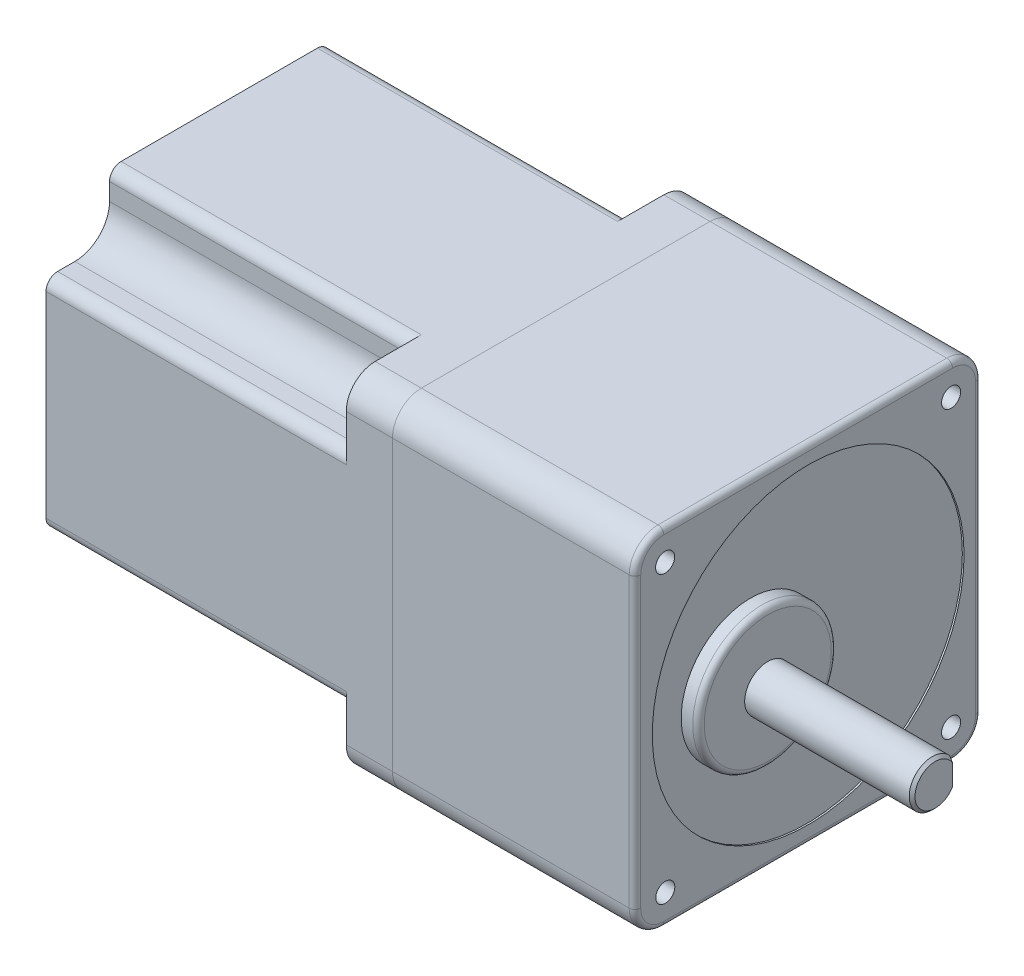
ISO-10303-21;
HEADER;
FILE_DESCRIPTION(('STEP AP214'),'2;1');
FILE_NAME('part.step','',(''),(''),'','','');
FILE_SCHEMA(('AUTOMOTIVE_DESIGN { 1 0 10303 214 1 1 1 1 }'));
ENDSEC;
DATA;
#1=APPLICATION_CONTEXT('core data for automotive mechanical design processes');
#2=APPLICATION_PROTOCOL_DEFINITION('international standard','automotive_design',2000,#1);
#3=PRODUCT_CONTEXT('',#1,'mechanical');
#4=PRODUCT('Part','Part','',(#3));
#5=PRODUCT_RELATED_PRODUCT_CATEGORY('part','',(#4));
#6=PRODUCT_DEFINITION_FORMATION('','',#4);
#7=PRODUCT_DEFINITION_CONTEXT('part definition',#1,'design');
#8=PRODUCT_DEFINITION('design','',#6,#7);
#9=PRODUCT_DEFINITION_SHAPE('','',#8);
#10=(LENGTH_UNIT() NAMED_UNIT(*) SI_UNIT(.MILLI.,.METRE.));
#11=(NAMED_UNIT(*) PLANE_ANGLE_UNIT() SI_UNIT($,.RADIAN.));
#12=(NAMED_UNIT(*) SI_UNIT($,.STERADIAN.) SOLID_ANGLE_UNIT());
#13=UNCERTAINTY_MEASURE_WITH_UNIT(LENGTH_MEASURE(1.E-05),#10,'distance_accuracy_value','');
#14=(GEOMETRIC_REPRESENTATION_CONTEXT(3) GLOBAL_UNCERTAINTY_ASSIGNED_CONTEXT((#13)) GLOBAL_UNIT_ASSIGNED_CONTEXT((#10,
#11,#12)) REPRESENTATION_CONTEXT('',''));
#15=CARTESIAN_POINT('',(0.,0.,0.));
#16=DIRECTION('',(0.,0.,1.));
#17=DIRECTION('',(1.,0.,0.));
#18=AXIS2_PLACEMENT_3D('',#15,#16,#17);
#19=CARTESIAN_POINT('',(41.7,0.,0.));
#20=DIRECTION('',(1.,0.,0.));
#21=DIRECTION('',(0.,0.,-1.));
#22=AXIS2_PLACEMENT_3D('',#19,#20,#21);
#23=CYLINDRICAL_SURFACE('',#22,27.);
#24=CARTESIAN_POINT('',(41.7,0.,0.));
#25=DIRECTION('',(1.,0.,0.));
#26=DIRECTION('',(0.,0.,-1.));
#27=AXIS2_PLACEMENT_3D('',#24,#25,#26);
#28=CIRCLE('',#27,27.);
#29=CARTESIAN_POINT('',(41.7,0.,-27.));
#30=VERTEX_POINT('',#29);
#31=EDGE_CURVE('E191',#30,#30,#28,.T.);
#32=ORIENTED_EDGE('',*,*,#31,.F.);
#33=EDGE_LOOP('',(#32));
#34=FACE_BOUND('',#33,.T.);
#35=CARTESIAN_POINT('',(42.,0.,0.));
#36=DIRECTION('',(1.,0.,0.));
#37=DIRECTION('',(0.,0.,-1.));
#38=AXIS2_PLACEMENT_3D('',#35,#36,#37);
#39=CIRCLE('',#38,27.);
#40=CARTESIAN_POINT('',(42.,0.,-27.));
#41=VERTEX_POINT('',#40);
#42=EDGE_CURVE('E218',#41,#41,#39,.T.);
#43=ORIENTED_EDGE('',*,*,#42,.T.);
#44=EDGE_LOOP('',(#43));
#45=FACE_BOUND('',#44,.T.);
#46=ADVANCED_FACE('F50',(#34,#45),#23,.F.);
#47=CARTESIAN_POINT('',(41.7,0.,0.));
#48=DIRECTION('',(1.,0.,0.));
#49=DIRECTION('',(0.,0.,-1.));
#50=AXIS2_PLACEMENT_3D('',#47,#48,#49);
#51=PLANE('',#50);
#52=ORIENTED_EDGE('',*,*,#31,.T.);
#53=EDGE_LOOP('',(#52));
#54=FACE_BOUND('',#53,.T.);
#55=ADVANCED_FACE('F375',(#54),#51,.T.);
#56=CARTESIAN_POINT('',(30.,24.7487373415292,-24.7487373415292));
#57=DIRECTION('',(-1.,0.,0.));
#58=DIRECTION('',(0.,0.,1.));
#59=AXIS2_PLACEMENT_3D('',#56,#57,#58);
#60=CYLINDRICAL_SURFACE('',#59,3.);
#61=CARTESIAN_POINT('',(30.,24.7487373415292,-24.7487373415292));
#62=DIRECTION('',(-1.,0.,0.));
#63=DIRECTION('',(0.,0.,1.));
#64=AXIS2_PLACEMENT_3D('',#61,#62,#63);
#65=CIRCLE('',#64,3.);
#66=CARTESIAN_POINT('',(30.,24.7487373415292,-21.7487373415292));
#67=VERTEX_POINT('',#66);
#68=EDGE_CURVE('E186',#67,#67,#65,.T.);
#69=ORIENTED_EDGE('',*,*,#68,.F.);
#70=EDGE_LOOP('',(#69));
#71=FACE_BOUND('',#70,.T.);
#72=CARTESIAN_POINT('',(0.,24.7487373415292,-24.7487373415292));
#73=DIRECTION('',(-1.,0.,0.));
#74=DIRECTION('',(0.,0.,1.));
#75=AXIS2_PLACEMENT_3D('',#72,#73,#74);
#76=CIRCLE('',#75,3.);
#77=CARTESIAN_POINT('',(0.,24.7487373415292,-21.7487373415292));
#78=VERTEX_POINT('',#77);
#79=EDGE_CURVE('E187',#78,#78,#76,.T.);
#80=ORIENTED_EDGE('',*,*,#79,.T.);
#81=EDGE_LOOP('',(#80));
#82=FACE_BOUND('',#81,.T.);
#83=ADVANCED_FACE('F381',(#71,#82),#60,.F.);
#84=CARTESIAN_POINT('',(30.,24.7487373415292,24.7487373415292));
#85=DIRECTION('',(-1.,0.,0.));
#86=DIRECTION('',(0.,0.,1.));
#87=AXIS2_PLACEMENT_3D('',#84,#85,#86);
#88=CYLINDRICAL_SURFACE('',#87,3.);
#89=CARTESIAN_POINT('',(30.,24.7487373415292,24.7487373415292));
#90=DIRECTION('',(-1.,0.,0.));
#91=DIRECTION('',(0.,0.,1.));
#92=AXIS2_PLACEMENT_3D('',#89,#90,#91);
#93=CIRCLE('',#92,3.);
#94=CARTESIAN_POINT('',(30.,24.7487373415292,27.7487373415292));
#95=VERTEX_POINT('',#94);
#96=EDGE_CURVE('E197',#95,#95,#93,.T.);
#97=ORIENTED_EDGE('',*,*,#96,.F.);
#98=EDGE_LOOP('',(#97));
#99=FACE_BOUND('',#98,.T.);
#100=CARTESIAN_POINT('',(0.,24.7487373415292,24.7487373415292));
#101=DIRECTION('',(-1.,0.,0.));
#102=DIRECTION('',(0.,0.,1.));
#103=AXIS2_PLACEMENT_3D('',#100,#101,#102);
#104=CIRCLE('',#103,3.);
#105=CARTESIAN_POINT('',(0.,24.7487373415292,27.7487373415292));
#106=VERTEX_POINT('',#105);
#107=EDGE_CURVE('E190',#106,#106,#104,.T.);
#108=ORIENTED_EDGE('',*,*,#107,.T.);
#109=EDGE_LOOP('',(#108));
#110=FACE_BOUND('',#109,.T.);
#111=ADVANCED_FACE('F548',(#99,#110),#88,.F.);
#112=CARTESIAN_POINT('',(30.,-24.7487373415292,24.7487373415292));
#113=DIRECTION('',(-1.,0.,0.));
#114=DIRECTION('',(0.,0.,1.));
#115=AXIS2_PLACEMENT_3D('',#112,#113,#114);
#116=CYLINDRICAL_SURFACE('',#115,3.);
#117=CARTESIAN_POINT('',(30.,-24.7487373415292,24.7487373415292));
#118=DIRECTION('',(-1.,0.,0.));
#119=DIRECTION('',(0.,0.,1.));
#120=AXIS2_PLACEMENT_3D('',#117,#118,#119);
#121=CIRCLE('',#120,3.);
#122=CARTESIAN_POINT('',(30.,-24.7487373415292,27.7487373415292));
#123=VERTEX_POINT('',#122);
#124=EDGE_CURVE('E206',#123,#123,#121,.T.);
#125=ORIENTED_EDGE('',*,*,#124,.F.);
#126=EDGE_LOOP('',(#125));
#127=FACE_BOUND('',#126,.T.);
#128=CARTESIAN_POINT('',(0.,-24.7487373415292,24.7487373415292));
#129=DIRECTION('',(-1.,0.,0.));
#130=DIRECTION('',(0.,0.,1.));
#131=AXIS2_PLACEMENT_3D('',#128,#129,#130);
#132=CIRCLE('',#131,3.);
#133=CARTESIAN_POINT('',(0.,-24.7487373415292,27.7487373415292));
#134=VERTEX_POINT('',#133);
#135=EDGE_CURVE('E200',#134,#134,#132,.T.);
#136=ORIENTED_EDGE('',*,*,#135,.T.);
#137=EDGE_LOOP('',(#136));
#138=FACE_BOUND('',#137,.T.);
#139=ADVANCED_FACE('F539',(#127,#138),#116,.F.);
#140=CARTESIAN_POINT('',(30.,-24.7487373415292,-24.7487373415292));
#141=DIRECTION('',(-1.,0.,0.));
#142=DIRECTION('',(0.,0.,1.));
#143=AXIS2_PLACEMENT_3D('',#140,#141,#142);
#144=CYLINDRICAL_SURFACE('',#143,3.);
#145=CARTESIAN_POINT('',(30.,-24.7487373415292,-24.7487373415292));
#146=DIRECTION('',(-1.,0.,0.));
#147=DIRECTION('',(0.,0.,1.));
#148=AXIS2_PLACEMENT_3D('',#145,#146,#147);
#149=CIRCLE('',#148,3.);
#150=CARTESIAN_POINT('',(30.,-24.7487373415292,-21.7487373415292));
#151=VERTEX_POINT('',#150);
#152=EDGE_CURVE('E185',#151,#151,#149,.T.);
#153=ORIENTED_EDGE('',*,*,#152,.F.);
#154=EDGE_LOOP('',(#153));
#155=FACE_BOUND('',#154,.T.);
#156=CARTESIAN_POINT('',(0.,-24.7487373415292,-24.7487373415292));
#157=DIRECTION('',(-1.,0.,0.));
#158=DIRECTION('',(0.,0.,1.));
#159=AXIS2_PLACEMENT_3D('',#156,#157,#158);
#160=CIRCLE('',#159,3.);
#161=CARTESIAN_POINT('',(0.,-24.7487373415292,-21.7487373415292));
#162=VERTEX_POINT('',#161);
#163=EDGE_CURVE('E203',#162,#162,#160,.T.);
#164=ORIENTED_EDGE('',*,*,#163,.T.);
#165=EDGE_LOOP('',(#164));
#166=FACE_BOUND('',#165,.T.);
#167=ADVANCED_FACE('F529',(#155,#166),#144,.F.);
#168=CARTESIAN_POINT('',(30.,24.7487373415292,24.7487373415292));
#169=DIRECTION('',(-1.,0.,0.));
#170=DIRECTION('',(0.,0.,1.));
#171=AXIS2_PLACEMENT_3D('',#168,#169,#170);
#172=PLANE('',#171);
#173=ORIENTED_EDGE('',*,*,#96,.T.);
#174=EDGE_LOOP('',(#173));
#175=FACE_BOUND('',#174,.T.);
#176=CARTESIAN_POINT('',(30.,24.7793364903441,24.7793364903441));
#177=DIRECTION('',(-1.,0.,0.));
#178=DIRECTION('',(0.,0.,1.));
#179=AXIS2_PLACEMENT_3D('',#176,#177,#178);
#180=CIRCLE('',#179,1.65);
#181=CARTESIAN_POINT('',(30.,24.7793364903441,26.4293364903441));
#182=VERTEX_POINT('',#181);
#183=EDGE_CURVE('E194',#182,#182,#180,.F.);
#184=ORIENTED_EDGE('',*,*,#183,.T.);
#185=EDGE_LOOP('',(#184));
#186=FACE_BOUND('',#185,.T.);
#187=ADVANCED_FACE('F519',(#175,#186),#172,.T.);
#188=CARTESIAN_POINT('',(30.,24.7487373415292,-24.7487373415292));
#189=DIRECTION('',(-1.,0.,0.));
#190=DIRECTION('',(0.,0.,1.));
#191=AXIS2_PLACEMENT_3D('',#188,#189,#190);
#192=PLANE('',#191);
#193=ORIENTED_EDGE('',*,*,#68,.T.);
#194=EDGE_LOOP('',(#193));
#195=FACE_BOUND('',#194,.T.);
#196=CARTESIAN_POINT('',(30.,24.7487373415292,-24.7487373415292));
#197=DIRECTION('',(-1.,0.,0.));
#198=DIRECTION('',(0.,0.,1.));
#199=AXIS2_PLACEMENT_3D('',#196,#197,#198);
#200=CIRCLE('',#199,1.65);
#201=CARTESIAN_POINT('',(30.,24.7487373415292,-23.0987373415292));
#202=VERTEX_POINT('',#201);
#203=EDGE_CURVE('E182',#202,#202,#200,.F.);
#204=ORIENTED_EDGE('',*,*,#203,.T.);
#205=EDGE_LOOP('',(#204));
#206=FACE_BOUND('',#205,.T.);
#207=ADVANCED_FACE('F510',(#195,#206),#192,.T.);
#208=CARTESIAN_POINT('',(30.,-24.7487373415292,-24.7487373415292));
#209=DIRECTION('',(-1.,0.,0.));
#210=DIRECTION('',(0.,0.,1.));
#211=AXIS2_PLACEMENT_3D('',#208,#209,#210);
#212=PLANE('',#211);
#213=ORIENTED_EDGE('',*,*,#152,.T.);
#214=EDGE_LOOP('',(#213));
#215=FACE_BOUND('',#214,.T.);
#216=CARTESIAN_POINT('',(30.,-24.7487373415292,-24.7487373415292));
#217=DIRECTION('',(-1.,0.,0.));
#218=DIRECTION('',(0.,0.,1.));
#219=AXIS2_PLACEMENT_3D('',#216,#217,#218);
#220=CIRCLE('',#219,1.65);
#221=CARTESIAN_POINT('',(30.,-24.7487373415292,-23.0987373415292));
#222=VERTEX_POINT('',#221);
#223=EDGE_CURVE('E211',#222,#222,#220,.F.);
#224=ORIENTED_EDGE('',*,*,#223,.T.);
#225=EDGE_LOOP('',(#224));
#226=FACE_BOUND('',#225,.T.);
#227=ADVANCED_FACE('F387',(#215,#226),#212,.T.);
#228=CARTESIAN_POINT('',(30.,-24.7487373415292,24.7487373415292));
#229=DIRECTION('',(-1.,0.,0.));
#230=DIRECTION('',(0.,0.,1.));
#231=AXIS2_PLACEMENT_3D('',#228,#229,#230);
#232=PLANE('',#231);
#233=ORIENTED_EDGE('',*,*,#124,.T.);
#234=EDGE_LOOP('',(#233));
#235=FACE_BOUND('',#234,.T.);
#236=CARTESIAN_POINT('',(30.,-24.7487373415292,24.7487373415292));
#237=DIRECTION('',(-1.,0.,0.));
#238=DIRECTION('',(0.,0.,1.));
#239=AXIS2_PLACEMENT_3D('',#236,#237,#238);
#240=CIRCLE('',#239,1.65);
#241=CARTESIAN_POINT('',(30.,-24.7487373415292,26.3987373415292));
#242=VERTEX_POINT('',#241);
#243=EDGE_CURVE('E181',#242,#242,#240,.F.);
#244=ORIENTED_EDGE('',*,*,#243,.T.);
#245=EDGE_LOOP('',(#244));
#246=FACE_BOUND('',#245,.T.);
#247=ADVANCED_FACE('F369',(#235,#246),#232,.T.);
#248=CARTESIAN_POINT('',(0.,-25.,25.));
#249=DIRECTION('',(-1.,0.,0.));
#250=DIRECTION('',(0.,0.,1.));
#251=AXIS2_PLACEMENT_3D('',#248,#249,#250);
#252=PLANE('',#251);
#253=ORIENTED_EDGE('',*,*,#163,.F.);
#254=EDGE_LOOP('',(#253));
#255=FACE_BOUND('',#254,.T.);
#256=ORIENTED_EDGE('',*,*,#135,.F.);
#257=EDGE_LOOP('',(#256));
#258=FACE_BOUND('',#257,.T.);
#259=ORIENTED_EDGE('',*,*,#107,.F.);
#260=EDGE_LOOP('',(#259));
#261=FACE_BOUND('',#260,.T.);
#262=ORIENTED_EDGE('',*,*,#79,.F.);
#263=EDGE_LOOP('',(#262));
#264=FACE_BOUND('',#263,.T.);
#265=CARTESIAN_POINT('',(0.,-25.,25.));
#266=DIRECTION('',(1.,0.,0.));
#267=DIRECTION('',(0.,0.,1.));
#268=AXIS2_PLACEMENT_3D('',#265,#266,#267);
#269=CIRCLE('',#268,5.);
#270=CARTESIAN_POINT('',(0.,-25.,30.));
#271=VERTEX_POINT('',#270);
#272=CARTESIAN_POINT('',(0.,-30.,25.));
#273=VERTEX_POINT('',#272);
#274=EDGE_CURVE('E145',#271,#273,#269,.T.);
#275=ORIENTED_EDGE('',*,*,#274,.F.);
#276=DIRECTION('',(0.,-1.,0.));
#277=VECTOR('',#276,1.);
#278=CARTESIAN_POINT('',(0.,-25.,30.));
#279=LINE('',#278,#277);
#280=CARTESIAN_POINT('',(0.,25.,30.));
#281=VERTEX_POINT('',#280);
#282=EDGE_CURVE('E151',#281,#271,#279,.T.);
#283=ORIENTED_EDGE('',*,*,#282,.F.);
#284=CARTESIAN_POINT('',(0.,25.,25.));
#285=DIRECTION('',(1.,0.,0.));
#286=DIRECTION('',(0.,0.,1.));
#287=AXIS2_PLACEMENT_3D('',#284,#285,#286);
#288=CIRCLE('',#287,5.);
#289=CARTESIAN_POINT('',(0.,30.,25.));
#290=VERTEX_POINT('',#289);
#291=EDGE_CURVE('E307',#290,#281,#288,.T.);
#292=ORIENTED_EDGE('',*,*,#291,.F.);
#293=DIRECTION('',(0.,0.,1.));
#294=VECTOR('',#293,1.);
#295=CARTESIAN_POINT('',(0.,30.,25.));
#296=LINE('',#295,#294);
#297=CARTESIAN_POINT('',(0.,30.,-25.));
#298=VERTEX_POINT('',#297);
#299=EDGE_CURVE('E304',#298,#290,#296,.T.);
#300=ORIENTED_EDGE('',*,*,#299,.F.);
#301=CARTESIAN_POINT('',(0.,25.,-25.));
#302=DIRECTION('',(1.,0.,0.));
#303=DIRECTION('',(0.,0.,1.));
#304=AXIS2_PLACEMENT_3D('',#301,#302,#303);
#305=CIRCLE('',#304,5.);
#306=CARTESIAN_POINT('',(0.,25.,-30.));
#307=VERTEX_POINT('',#306);
#308=EDGE_CURVE('E295',#307,#298,#305,.T.);
#309=ORIENTED_EDGE('',*,*,#308,.F.);
#310=DIRECTION('',(0.,1.,0.));
#311=VECTOR('',#310,1.);
#312=CARTESIAN_POINT('',(0.,-25.,-30.));
#313=LINE('',#312,#311);
#314=CARTESIAN_POINT('',(0.,-25.,-30.));
#315=VERTEX_POINT('',#314);
#316=EDGE_CURVE('E293',#315,#307,#313,.T.);
#317=ORIENTED_EDGE('',*,*,#316,.F.);
#318=CARTESIAN_POINT('',(0.,-25.,-25.));
#319=DIRECTION('',(1.,0.,0.));
#320=DIRECTION('',(0.,0.,-1.));
#321=AXIS2_PLACEMENT_3D('',#318,#319,#320);
#322=CIRCLE('',#321,5.);
#323=CARTESIAN_POINT('',(0.,-30.,-25.));
#324=VERTEX_POINT('',#323);
#325=EDGE_CURVE('E311',#324,#315,#322,.T.);
#326=ORIENTED_EDGE('',*,*,#325,.F.);
#327=DIRECTION('',(0.,0.,-1.));
#328=VECTOR('',#327,1.);
#329=CARTESIAN_POINT('',(0.,-30.,25.));
#330=LINE('',#329,#328);
#331=EDGE_CURVE('E163',#273,#324,#330,.T.);
#332=ORIENTED_EDGE('',*,*,#331,.F.);
#333=EDGE_LOOP('',(#275,#283,#292,#300,#309,#317,#326,#332));
#334=FACE_BOUND('',#333,.T.);
#335=ADVANCED_FACE('F160',(#255,#258,#261,#264,#334),#252,.T.);
#336=CARTESIAN_POINT('',(42.,24.7793364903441,24.7793364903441));
#337=DIRECTION('',(1.,0.,0.));
#338=DIRECTION('',(0.,0.,-1.));
#339=AXIS2_PLACEMENT_3D('',#336,#337,#338);
#340=CYLINDRICAL_SURFACE('',#339,1.65);
#341=ORIENTED_EDGE('',*,*,#183,.F.);
#342=EDGE_LOOP('',(#341));
#343=FACE_BOUND('',#342,.T.);
#344=CARTESIAN_POINT('',(42.,24.7793364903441,24.7793364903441));
#345=DIRECTION('',(1.,0.,0.));
#346=DIRECTION('',(0.,0.,-1.));
#347=AXIS2_PLACEMENT_3D('',#344,#345,#346);
#348=CIRCLE('',#347,1.65);
#349=CARTESIAN_POINT('',(42.,24.7793364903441,23.1293364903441));
#350=VERTEX_POINT('',#349);
#351=EDGE_CURVE('E178',#350,#350,#348,.T.);
#352=ORIENTED_EDGE('',*,*,#351,.T.);
#353=EDGE_LOOP('',(#352));
#354=FACE_BOUND('',#353,.T.);
#355=ADVANCED_FACE('F357',(#343,#354),#340,.F.);
#356=CARTESIAN_POINT('',(42.,24.7487373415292,-24.7487373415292));
#357=DIRECTION('',(1.,0.,0.));
#358=DIRECTION('',(0.,0.,-1.));
#359=AXIS2_PLACEMENT_3D('',#356,#357,#358);
#360=CYLINDRICAL_SURFACE('',#359,1.65);
#361=ORIENTED_EDGE('',*,*,#203,.F.);
#362=EDGE_LOOP('',(#361));
#363=FACE_BOUND('',#362,.T.);
#364=CARTESIAN_POINT('',(42.,24.7487373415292,-24.7487373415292));
#365=DIRECTION('',(1.,0.,0.));
#366=DIRECTION('',(0.,0.,-1.));
#367=AXIS2_PLACEMENT_3D('',#364,#365,#366);
#368=CIRCLE('',#367,1.65);
#369=CARTESIAN_POINT('',(42.,24.7487373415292,-26.3987373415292));
#370=VERTEX_POINT('',#369);
#371=EDGE_CURVE('E175',#370,#370,#368,.T.);
#372=ORIENTED_EDGE('',*,*,#371,.T.);
#373=EDGE_LOOP('',(#372));
#374=FACE_BOUND('',#373,.T.);
#375=ADVANCED_FACE('F359',(#363,#374),#360,.F.);
#376=CARTESIAN_POINT('',(42.,-24.7487373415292,-24.7487373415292));
#377=DIRECTION('',(1.,0.,0.));
#378=DIRECTION('',(0.,0.,-1.));
#379=AXIS2_PLACEMENT_3D('',#376,#377,#378);
#380=CYLINDRICAL_SURFACE('',#379,1.65);
#381=ORIENTED_EDGE('',*,*,#223,.F.);
#382=EDGE_LOOP('',(#381));
#383=FACE_BOUND('',#382,.T.);
#384=CARTESIAN_POINT('',(42.,-24.7487373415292,-24.7487373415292));
#385=DIRECTION('',(1.,0.,0.));
#386=DIRECTION('',(0.,0.,-1.));
#387=AXIS2_PLACEMENT_3D('',#384,#385,#386);
#388=CIRCLE('',#387,1.65);
#389=CARTESIAN_POINT('',(42.,-24.7487373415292,-26.3987373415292));
#390=VERTEX_POINT('',#389);
#391=EDGE_CURVE('E172',#390,#390,#388,.T.);
#392=ORIENTED_EDGE('',*,*,#391,.T.);
#393=EDGE_LOOP('',(#392));
#394=FACE_BOUND('',#393,.T.);
#395=ADVANCED_FACE('F366',(#383,#394),#380,.F.);
#396=CARTESIAN_POINT('',(42.,-24.7487373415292,24.7487373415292));
#397=DIRECTION('',(1.,0.,0.));
#398=DIRECTION('',(0.,0.,-1.));
#399=AXIS2_PLACEMENT_3D('',#396,#397,#398);
#400=CYLINDRICAL_SURFACE('',#399,1.65);
#401=ORIENTED_EDGE('',*,*,#243,.F.);
#402=EDGE_LOOP('',(#401));
#403=FACE_BOUND('',#402,.T.);
#404=CARTESIAN_POINT('',(42.,-24.7487373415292,24.7487373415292));
#405=DIRECTION('',(1.,0.,0.));
#406=DIRECTION('',(0.,0.,-1.));
#407=AXIS2_PLACEMENT_3D('',#404,#405,#406);
#408=CIRCLE('',#407,1.65);
#409=CARTESIAN_POINT('',(42.,-24.7487373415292,23.0987373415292));
#410=VERTEX_POINT('',#409);
#411=EDGE_CURVE('E157',#410,#410,#408,.T.);
#412=ORIENTED_EDGE('',*,*,#411,.T.);
#413=EDGE_LOOP('',(#412));
#414=FACE_BOUND('',#413,.T.);
#415=ADVANCED_FACE('F462',(#403,#414),#400,.F.);
#416=CARTESIAN_POINT('',(42.,-25.,30.));
#417=DIRECTION('',(0.,0.,-1.));
#418=DIRECTION('',(-1.,0.,0.));
#419=AXIS2_PLACEMENT_3D('',#416,#417,#418);
#420=PLANE('',#419);
#421=DIRECTION('',(-1.,0.,0.));
#422=VECTOR('',#421,1.);
#423=CARTESIAN_POINT('',(42.,-25.,30.));
#424=LINE('',#423,#422);
#425=CARTESIAN_POINT('',(41.,-25.,30.));
#426=VERTEX_POINT('',#425);
#427=EDGE_CURVE('E140',#426,#271,#424,.T.);
#428=ORIENTED_EDGE('',*,*,#427,.F.);
#429=DIRECTION('',(0.,-1.,0.));
#430=VECTOR('',#429,1.);
#431=CARTESIAN_POINT('',(41.,-25.,30.));
#432=LINE('',#431,#430);
#433=CARTESIAN_POINT('',(41.,25.,30.));
#434=VERTEX_POINT('',#433);
#435=EDGE_CURVE('E74',#426,#434,#432,.F.);
#436=ORIENTED_EDGE('',*,*,#435,.T.);
#437=DIRECTION('',(-1.,0.,0.));
#438=VECTOR('',#437,1.);
#439=CARTESIAN_POINT('',(42.,25.,30.));
#440=LINE('',#439,#438);
#441=EDGE_CURVE('E153',#434,#281,#440,.T.);
#442=ORIENTED_EDGE('',*,*,#441,.T.);
#443=ORIENTED_EDGE('',*,*,#282,.T.);
#444=EDGE_LOOP('',(#428,#436,#442,#443));
#445=FACE_BOUND('',#444,.T.);
#446=ADVANCED_FACE('F152',(#445),#420,.F.);
#447=CARTESIAN_POINT('',(42.,25.,25.));
#448=DIRECTION('',(-1.,0.,0.));
#449=DIRECTION('',(0.,0.,1.));
#450=AXIS2_PLACEMENT_3D('',#447,#448,#449);
#451=CYLINDRICAL_SURFACE('',#450,5.);
#452=ORIENTED_EDGE('',*,*,#441,.F.);
#453=CARTESIAN_POINT('',(41.,25.,25.));
#454=DIRECTION('',(-1.,0.,0.));
#455=DIRECTION('',(0.,0.,1.));
#456=AXIS2_PLACEMENT_3D('',#453,#454,#455);
#457=CIRCLE('',#456,5.);
#458=CARTESIAN_POINT('',(41.,30.,25.));
#459=VERTEX_POINT('',#458);
#460=EDGE_CURVE('E59',#434,#459,#457,.T.);
#461=ORIENTED_EDGE('',*,*,#460,.T.);
#462=DIRECTION('',(-1.,0.,0.));
#463=VECTOR('',#462,1.);
#464=CARTESIAN_POINT('',(42.,30.,25.));
#465=LINE('',#464,#463);
#466=EDGE_CURVE('E305',#459,#290,#465,.T.);
#467=ORIENTED_EDGE('',*,*,#466,.T.);
#468=ORIENTED_EDGE('',*,*,#291,.T.);
#469=EDGE_LOOP('',(#452,#461,#467,#468));
#470=FACE_BOUND('',#469,.T.);
#471=ADVANCED_FACE('F448',(#470),#451,.T.);
#472=CARTESIAN_POINT('',(42.,30.,25.));
#473=DIRECTION('',(0.,-1.,0.));
#474=DIRECTION('',(0.,0.,-1.));
#475=AXIS2_PLACEMENT_3D('',#472,#473,#474);
#476=PLANE('',#475);
#477=ORIENTED_EDGE('',*,*,#466,.F.);
#478=DIRECTION('',(0.,0.,1.));
#479=VECTOR('',#478,1.);
#480=CARTESIAN_POINT('',(41.,30.,25.));
#481=LINE('',#480,#479);
#482=CARTESIAN_POINT('',(41.,30.,-25.));
#483=VERTEX_POINT('',#482);
#484=EDGE_CURVE('E12',#459,#483,#481,.F.);
#485=ORIENTED_EDGE('',*,*,#484,.T.);
#486=DIRECTION('',(-1.,0.,0.));
#487=VECTOR('',#486,1.);
#488=CARTESIAN_POINT('',(42.,30.,-25.));
#489=LINE('',#488,#487);
#490=EDGE_CURVE('E288',#483,#298,#489,.T.);
#491=ORIENTED_EDGE('',*,*,#490,.T.);
#492=ORIENTED_EDGE('',*,*,#299,.T.);
#493=EDGE_LOOP('',(#477,#485,#491,#492));
#494=FACE_BOUND('',#493,.T.);
#495=ADVANCED_FACE('F441',(#494),#476,.F.);
#496=CARTESIAN_POINT('',(42.,25.,-25.));
#497=DIRECTION('',(-1.,0.,0.));
#498=DIRECTION('',(0.,0.,1.));
#499=AXIS2_PLACEMENT_3D('',#496,#497,#498);
#500=CYLINDRICAL_SURFACE('',#499,5.);
#501=ORIENTED_EDGE('',*,*,#490,.F.);
#502=CARTESIAN_POINT('',(41.,25.,-25.));
#503=DIRECTION('',(-1.,0.,0.));
#504=DIRECTION('',(0.,0.,1.));
#505=AXIS2_PLACEMENT_3D('',#502,#503,#504);
#506=CIRCLE('',#505,5.);
#507=CARTESIAN_POINT('',(41.,25.,-30.));
#508=VERTEX_POINT('',#507);
#509=EDGE_CURVE('E246',#483,#508,#506,.T.);
#510=ORIENTED_EDGE('',*,*,#509,.T.);
#511=DIRECTION('',(-1.,0.,0.));
#512=VECTOR('',#511,1.);
#513=CARTESIAN_POINT('',(42.,25.,-30.));
#514=LINE('',#513,#512);
#515=EDGE_CURVE('E286',#508,#307,#514,.T.);
#516=ORIENTED_EDGE('',*,*,#515,.T.);
#517=ORIENTED_EDGE('',*,*,#308,.T.);
#518=EDGE_LOOP('',(#501,#510,#516,#517));
#519=FACE_BOUND('',#518,.T.);
#520=ADVANCED_FACE('F284',(#519),#500,.T.);
#521=CARTESIAN_POINT('',(42.,-25.,-30.));
#522=DIRECTION('',(0.,0.,1.));
#523=DIRECTION('',(1.,0.,0.));
#524=AXIS2_PLACEMENT_3D('',#521,#522,#523);
#525=PLANE('',#524);
#526=ORIENTED_EDGE('',*,*,#515,.F.);
#527=DIRECTION('',(0.,1.,0.));
#528=VECTOR('',#527,1.);
#529=CARTESIAN_POINT('',(41.,-25.,-30.));
#530=LINE('',#529,#528);
#531=CARTESIAN_POINT('',(41.,-25.,-30.));
#532=VERTEX_POINT('',#531);
#533=EDGE_CURVE('E244',#508,#532,#530,.F.);
#534=ORIENTED_EDGE('',*,*,#533,.T.);
#535=DIRECTION('',(-1.,0.,0.));
#536=VECTOR('',#535,1.);
#537=CARTESIAN_POINT('',(42.,-25.,-30.));
#538=LINE('',#537,#536);
#539=EDGE_CURVE('E297',#532,#315,#538,.T.);
#540=ORIENTED_EDGE('',*,*,#539,.T.);
#541=ORIENTED_EDGE('',*,*,#316,.T.);
#542=EDGE_LOOP('',(#526,#534,#540,#541));
#543=FACE_BOUND('',#542,.T.);
#544=ADVANCED_FACE('F290',(#543),#525,.F.);
#545=CARTESIAN_POINT('',(42.,-25.,-25.));
#546=DIRECTION('',(-1.,0.,0.));
#547=DIRECTION('',(0.,0.,1.));
#548=AXIS2_PLACEMENT_3D('',#545,#546,#547);
#549=CYLINDRICAL_SURFACE('',#548,5.);
#550=ORIENTED_EDGE('',*,*,#539,.F.);
#551=CARTESIAN_POINT('',(41.,-25.,-25.));
#552=DIRECTION('',(-1.,0.,0.));
#553=DIRECTION('',(0.,0.,1.));
#554=AXIS2_PLACEMENT_3D('',#551,#552,#553);
#555=CIRCLE('',#554,5.);
#556=CARTESIAN_POINT('',(41.,-30.,-25.));
#557=VERTEX_POINT('',#556);
#558=EDGE_CURVE('E242',#532,#557,#555,.T.);
#559=ORIENTED_EDGE('',*,*,#558,.T.);
#560=DIRECTION('',(-1.,0.,0.));
#561=VECTOR('',#560,1.);
#562=CARTESIAN_POINT('',(42.,-30.,-25.));
#563=LINE('',#562,#561);
#564=EDGE_CURVE('E313',#557,#324,#563,.T.);
#565=ORIENTED_EDGE('',*,*,#564,.T.);
#566=ORIENTED_EDGE('',*,*,#325,.T.);
#567=EDGE_LOOP('',(#550,#559,#565,#566));
#568=FACE_BOUND('',#567,.T.);
#569=ADVANCED_FACE('F316',(#568),#549,.T.);
#570=CARTESIAN_POINT('',(42.,-30.,25.));
#571=DIRECTION('',(0.,1.,0.));
#572=DIRECTION('',(0.,0.,1.));
#573=AXIS2_PLACEMENT_3D('',#570,#571,#572);
#574=PLANE('',#573);
#575=ORIENTED_EDGE('',*,*,#564,.F.);
#576=DIRECTION('',(0.,0.,-1.));
#577=VECTOR('',#576,1.);
#578=CARTESIAN_POINT('',(41.,-30.,25.));
#579=LINE('',#578,#577);
#580=CARTESIAN_POINT('',(41.,-30.,25.));
#581=VERTEX_POINT('',#580);
#582=EDGE_CURVE('E240',#557,#581,#579,.F.);
#583=ORIENTED_EDGE('',*,*,#582,.T.);
#584=DIRECTION('',(-1.,0.,0.));
#585=VECTOR('',#584,1.);
#586=CARTESIAN_POINT('',(42.,-30.,25.));
#587=LINE('',#586,#585);
#588=EDGE_CURVE('E164',#581,#273,#587,.T.);
#589=ORIENTED_EDGE('',*,*,#588,.T.);
#590=ORIENTED_EDGE('',*,*,#331,.T.);
#591=EDGE_LOOP('',(#575,#583,#589,#590));
#592=FACE_BOUND('',#591,.T.);
#593=ADVANCED_FACE('F330',(#592),#574,.F.);
#594=CARTESIAN_POINT('',(42.,-25.,25.));
#595=DIRECTION('',(-1.,0.,0.));
#596=DIRECTION('',(0.,0.,1.));
#597=AXIS2_PLACEMENT_3D('',#594,#595,#596);
#598=CYLINDRICAL_SURFACE('',#597,5.);
#599=ORIENTED_EDGE('',*,*,#588,.F.);
#600=CARTESIAN_POINT('',(41.,-25.,25.));
#601=DIRECTION('',(-1.,0.,0.));
#602=DIRECTION('',(0.,0.,1.));
#603=AXIS2_PLACEMENT_3D('',#600,#601,#602);
#604=CIRCLE('',#603,5.);
#605=EDGE_CURVE('E147',#581,#426,#604,.T.);
#606=ORIENTED_EDGE('',*,*,#605,.T.);
#607=ORIENTED_EDGE('',*,*,#427,.T.);
#608=ORIENTED_EDGE('',*,*,#274,.T.);
#609=EDGE_LOOP('',(#599,#606,#607,#608));
#610=FACE_BOUND('',#609,.T.);
#611=ADVANCED_FACE('F143',(#610),#598,.T.);
#612=CARTESIAN_POINT('',(42.,-25.,25.));
#613=DIRECTION('',(-1.,0.,0.));
#614=DIRECTION('',(0.,0.,1.));
#615=AXIS2_PLACEMENT_3D('',#612,#613,#614);
#616=PLANE('',#615);
#617=DIRECTION('',(0.,-1.,0.));
#618=VECTOR('',#617,1.);
#619=CARTESIAN_POINT('',(42.,-25.,29.));
#620=LINE('',#619,#618);
#621=CARTESIAN_POINT('',(42.,25.,29.));
#622=VERTEX_POINT('',#621);
#623=CARTESIAN_POINT('',(42.,-25.,29.));
#624=VERTEX_POINT('',#623);
#625=EDGE_CURVE('E226',#622,#624,#620,.T.);
#626=ORIENTED_EDGE('',*,*,#625,.T.);
#627=CARTESIAN_POINT('',(42.,-25.,25.));
#628=DIRECTION('',(-1.,0.,0.));
#629=DIRECTION('',(0.,0.,1.));
#630=AXIS2_PLACEMENT_3D('',#627,#628,#629);
#631=CIRCLE('',#630,4.);
#632=CARTESIAN_POINT('',(42.,-29.,25.));
#633=VERTEX_POINT('',#632);
#634=EDGE_CURVE('E236',#624,#633,#631,.F.);
#635=ORIENTED_EDGE('',*,*,#634,.T.);
#636=DIRECTION('',(0.,0.,-1.));
#637=VECTOR('',#636,1.);
#638=CARTESIAN_POINT('',(42.,-29.,25.));
#639=LINE('',#638,#637);
#640=CARTESIAN_POINT('',(42.,-29.,-25.));
#641=VERTEX_POINT('',#640);
#642=EDGE_CURVE('E234',#633,#641,#639,.T.);
#643=ORIENTED_EDGE('',*,*,#642,.T.);
#644=CARTESIAN_POINT('',(42.,-25.,-25.));
#645=DIRECTION('',(-1.,0.,0.));
#646=DIRECTION('',(0.,0.,1.));
#647=AXIS2_PLACEMENT_3D('',#644,#645,#646);
#648=CIRCLE('',#647,4.);
#649=CARTESIAN_POINT('',(42.,-25.,-29.));
#650=VERTEX_POINT('',#649);
#651=EDGE_CURVE('E232',#641,#650,#648,.F.);
#652=ORIENTED_EDGE('',*,*,#651,.T.);
#653=DIRECTION('',(0.,1.,0.));
#654=VECTOR('',#653,1.);
#655=CARTESIAN_POINT('',(42.,-25.,-29.));
#656=LINE('',#655,#654);
#657=CARTESIAN_POINT('',(42.,25.,-29.));
#658=VERTEX_POINT('',#657);
#659=EDGE_CURVE('E230',#650,#658,#656,.T.);
#660=ORIENTED_EDGE('',*,*,#659,.T.);
#661=CARTESIAN_POINT('',(42.,25.,-25.));
#662=DIRECTION('',(-1.,0.,0.));
#663=DIRECTION('',(0.,0.,1.));
#664=AXIS2_PLACEMENT_3D('',#661,#662,#663);
#665=CIRCLE('',#664,4.);
#666=CARTESIAN_POINT('',(42.,29.,-25.));
#667=VERTEX_POINT('',#666);
#668=EDGE_CURVE('E228',#658,#667,#665,.F.);
#669=ORIENTED_EDGE('',*,*,#668,.T.);
#670=DIRECTION('',(0.,0.,1.));
#671=VECTOR('',#670,1.);
#672=CARTESIAN_POINT('',(42.,29.,25.));
#673=LINE('',#672,#671);
#674=CARTESIAN_POINT('',(42.,29.,25.));
#675=VERTEX_POINT('',#674);
#676=EDGE_CURVE('E148',#667,#675,#673,.T.);
#677=ORIENTED_EDGE('',*,*,#676,.T.);
#678=CARTESIAN_POINT('',(42.,25.,25.));
#679=DIRECTION('',(-1.,0.,0.));
#680=DIRECTION('',(0.,0.,1.));
#681=AXIS2_PLACEMENT_3D('',#678,#679,#680);
#682=CIRCLE('',#681,4.);
#683=EDGE_CURVE('E224',#675,#622,#682,.F.);
#684=ORIENTED_EDGE('',*,*,#683,.T.);
#685=EDGE_LOOP('',(#626,#635,#643,#652,#660,#669,#677,#684));
#686=FACE_BOUND('',#685,.T.);
#687=ORIENTED_EDGE('',*,*,#42,.F.);
#688=EDGE_LOOP('',(#687));
#689=FACE_BOUND('',#688,.T.);
#690=ORIENTED_EDGE('',*,*,#411,.F.);
#691=EDGE_LOOP('',(#690));
#692=FACE_BOUND('',#691,.T.);
#693=ORIENTED_EDGE('',*,*,#391,.F.);
#694=EDGE_LOOP('',(#693));
#695=FACE_BOUND('',#694,.T.);
#696=ORIENTED_EDGE('',*,*,#371,.F.);
#697=EDGE_LOOP('',(#696));
#698=FACE_BOUND('',#697,.T.);
#699=ORIENTED_EDGE('',*,*,#351,.F.);
#700=EDGE_LOOP('',(#699));
#701=FACE_BOUND('',#700,.T.);
#702=ADVANCED_FACE('F343',(#686,#689,#692,#695,#698,#701),#616,.F.);
#703=CARTESIAN_POINT('',(41.,25.,-25.));
#704=DIRECTION('',(-1.,0.,0.));
#705=DIRECTION('',(0.,0.,1.));
#706=AXIS2_PLACEMENT_3D('',#703,#704,#705);
#707=TOROIDAL_SURFACE('',#706,4.,1.);
#708=CARTESIAN_POINT('',(41.,25.,-29.));
#709=DIRECTION('',(0.,-1.,0.));
#710=DIRECTION('',(0.,0.,-1.));
#711=AXIS2_PLACEMENT_3D('',#708,#709,#710);
#712=CIRCLE('',#711,1.);
#713=EDGE_CURVE('E265',#508,#658,#712,.T.);
#714=ORIENTED_EDGE('',*,*,#713,.F.);
#715=ORIENTED_EDGE('',*,*,#509,.F.);
#716=CARTESIAN_POINT('',(41.,29.,-25.));
#717=DIRECTION('',(0.,0.,1.));
#718=DIRECTION('',(0.,-1.,0.));
#719=AXIS2_PLACEMENT_3D('',#716,#717,#718);
#720=CIRCLE('',#719,1.);
#721=EDGE_CURVE('E54',#667,#483,#720,.T.);
#722=ORIENTED_EDGE('',*,*,#721,.F.);
#723=ORIENTED_EDGE('',*,*,#668,.F.);
#724=EDGE_LOOP('',(#714,#715,#722,#723));
#725=FACE_BOUND('',#724,.T.);
#726=ADVANCED_FACE('F52',(#725),#707,.T.);
#727=CARTESIAN_POINT('',(41.,29.,25.));
#728=DIRECTION('',(0.,0.,1.));
#729=DIRECTION('',(1.,0.,0.));
#730=AXIS2_PLACEMENT_3D('',#727,#728,#729);
#731=CYLINDRICAL_SURFACE('',#730,1.);
#732=ORIENTED_EDGE('',*,*,#721,.T.);
#733=ORIENTED_EDGE('',*,*,#484,.F.);
#734=CARTESIAN_POINT('',(41.,29.,25.));
#735=DIRECTION('',(0.,0.,1.));
#736=DIRECTION('',(0.,-1.,0.));
#737=AXIS2_PLACEMENT_3D('',#734,#735,#736);
#738=CIRCLE('',#737,1.);
#739=EDGE_CURVE('E263',#675,#459,#738,.T.);
#740=ORIENTED_EDGE('',*,*,#739,.F.);
#741=ORIENTED_EDGE('',*,*,#676,.F.);
#742=EDGE_LOOP('',(#732,#733,#740,#741));
#743=FACE_BOUND('',#742,.T.);
#744=ADVANCED_FACE('F276',(#743),#731,.T.);
#745=CARTESIAN_POINT('',(41.,-25.,-29.));
#746=DIRECTION('',(0.,1.,0.));
#747=DIRECTION('',(0.,0.,1.));
#748=AXIS2_PLACEMENT_3D('',#745,#746,#747);
#749=CYLINDRICAL_SURFACE('',#748,1.);
#750=ORIENTED_EDGE('',*,*,#713,.T.);
#751=ORIENTED_EDGE('',*,*,#659,.F.);
#752=CARTESIAN_POINT('',(41.,-25.,-29.));
#753=DIRECTION('',(0.,-1.,0.));
#754=DIRECTION('',(1.,0.,0.));
#755=AXIS2_PLACEMENT_3D('',#752,#753,#754);
#756=CIRCLE('',#755,1.);
#757=EDGE_CURVE('E260',#532,#650,#756,.T.);
#758=ORIENTED_EDGE('',*,*,#757,.F.);
#759=ORIENTED_EDGE('',*,*,#533,.F.);
#760=EDGE_LOOP('',(#750,#751,#758,#759));
#761=FACE_BOUND('',#760,.T.);
#762=ADVANCED_FACE('F319',(#761),#749,.T.);
#763=CARTESIAN_POINT('',(41.,25.,25.));
#764=DIRECTION('',(-1.,0.,0.));
#765=DIRECTION('',(0.,0.,1.));
#766=AXIS2_PLACEMENT_3D('',#763,#764,#765);
#767=TOROIDAL_SURFACE('',#766,4.,1.);
#768=ORIENTED_EDGE('',*,*,#739,.T.);
#769=ORIENTED_EDGE('',*,*,#460,.F.);
#770=CARTESIAN_POINT('',(41.,25.,29.));
#771=DIRECTION('',(0.,-1.,0.));
#772=DIRECTION('',(0.,0.,-1.));
#773=AXIS2_PLACEMENT_3D('',#770,#771,#772);
#774=CIRCLE('',#773,1.);
#775=EDGE_CURVE('E257',#622,#434,#774,.T.);
#776=ORIENTED_EDGE('',*,*,#775,.F.);
#777=ORIENTED_EDGE('',*,*,#683,.F.);
#778=EDGE_LOOP('',(#768,#769,#776,#777));
#779=FACE_BOUND('',#778,.T.);
#780=ADVANCED_FACE('F341',(#779),#767,.T.);
#781=CARTESIAN_POINT('',(41.,-25.,-25.));
#782=DIRECTION('',(-1.,0.,0.));
#783=DIRECTION('',(0.,0.,1.));
#784=AXIS2_PLACEMENT_3D('',#781,#782,#783);
#785=TOROIDAL_SURFACE('',#784,4.,1.);
#786=ORIENTED_EDGE('',*,*,#757,.T.);
#787=ORIENTED_EDGE('',*,*,#651,.F.);
#788=CARTESIAN_POINT('',(41.,-29.,-25.));
#789=DIRECTION('',(0.,0.,1.));
#790=DIRECTION('',(0.,-1.,0.));
#791=AXIS2_PLACEMENT_3D('',#788,#789,#790);
#792=CIRCLE('',#791,1.);
#793=EDGE_CURVE('E254',#557,#641,#792,.T.);
#794=ORIENTED_EDGE('',*,*,#793,.F.);
#795=ORIENTED_EDGE('',*,*,#558,.F.);
#796=EDGE_LOOP('',(#786,#787,#794,#795));
#797=FACE_BOUND('',#796,.T.);
#798=ADVANCED_FACE('F323',(#797),#785,.T.);
#799=CARTESIAN_POINT('',(41.,-25.,29.));
#800=DIRECTION('',(0.,-1.,0.));
#801=DIRECTION('',(0.,0.,-1.));
#802=AXIS2_PLACEMENT_3D('',#799,#800,#801);
#803=CYLINDRICAL_SURFACE('',#802,1.);
#804=ORIENTED_EDGE('',*,*,#775,.T.);
#805=ORIENTED_EDGE('',*,*,#435,.F.);
#806=CARTESIAN_POINT('',(41.,-25.,29.));
#807=DIRECTION('',(0.,-1.,0.));
#808=DIRECTION('',(0.,0.,-1.));
#809=AXIS2_PLACEMENT_3D('',#806,#807,#808);
#810=CIRCLE('',#809,1.);
#811=EDGE_CURVE('E252',#624,#426,#810,.T.);
#812=ORIENTED_EDGE('',*,*,#811,.F.);
#813=ORIENTED_EDGE('',*,*,#625,.F.);
#814=EDGE_LOOP('',(#804,#805,#812,#813));
#815=FACE_BOUND('',#814,.T.);
#816=ADVANCED_FACE('F337',(#815),#803,.T.);
#817=CARTESIAN_POINT('',(41.,-29.,25.));
#818=DIRECTION('',(0.,0.,-1.));
#819=DIRECTION('',(-1.,0.,0.));
#820=AXIS2_PLACEMENT_3D('',#817,#818,#819);
#821=CYLINDRICAL_SURFACE('',#820,1.);
#822=ORIENTED_EDGE('',*,*,#793,.T.);
#823=ORIENTED_EDGE('',*,*,#642,.F.);
#824=CARTESIAN_POINT('',(41.,-29.,25.));
#825=DIRECTION('',(0.,0.,1.));
#826=DIRECTION('',(1.,0.,0.));
#827=AXIS2_PLACEMENT_3D('',#824,#825,#826);
#828=CIRCLE('',#827,1.);
#829=EDGE_CURVE('E250',#581,#633,#828,.T.);
#830=ORIENTED_EDGE('',*,*,#829,.F.);
#831=ORIENTED_EDGE('',*,*,#582,.F.);
#832=EDGE_LOOP('',(#822,#823,#830,#831));
#833=FACE_BOUND('',#832,.T.);
#834=ADVANCED_FACE('F328',(#833),#821,.T.);
#835=CARTESIAN_POINT('',(41.,-25.,25.));
#836=DIRECTION('',(-1.,0.,0.));
#837=DIRECTION('',(0.,0.,1.));
#838=AXIS2_PLACEMENT_3D('',#835,#836,#837);
#839=TOROIDAL_SURFACE('',#838,4.,1.);
#840=ORIENTED_EDGE('',*,*,#811,.T.);
#841=ORIENTED_EDGE('',*,*,#605,.F.);
#842=ORIENTED_EDGE('',*,*,#829,.T.);
#843=ORIENTED_EDGE('',*,*,#634,.F.);
#844=EDGE_LOOP('',(#840,#841,#842,#843));
#845=FACE_BOUND('',#844,.T.);
#846=ADVANCED_FACE('F332',(#845),#839,.T.);
#847=CLOSED_SHELL('',(#46,#55,#83,#111,#139,#167,#187,#207,#227,#247,#335,#355,#375,#395,#415,
#446,#471,#495,#520,#544,#569,#593,#611,#702,#726,#744,#762,#780,#798,#816,#834,#846));
#848=MANIFOLD_SOLID_BREP('B2',#847);
#849=CARTESIAN_POINT('',(45.,0.,10.));
#850=DIRECTION('',(1.,0.,0.));
#851=DIRECTION('',(0.,0.,-1.));
#852=AXIS2_PLACEMENT_3D('',#849,#850,#851);
#853=PLANE('',#852);
#854=CARTESIAN_POINT('',(45.,0.,10.));
#855=DIRECTION('',(1.,0.,0.));
#856=DIRECTION('',(0.,0.,-1.));
#857=AXIS2_PLACEMENT_3D('',#854,#855,#856);
#858=CIRCLE('',#857,11.);
#859=CARTESIAN_POINT('',(45.,0.,-1.));
#860=VERTEX_POINT('',#859);
#861=EDGE_CURVE('E750',#860,#860,#858,.T.);
#862=ORIENTED_EDGE('',*,*,#861,.T.);
#863=EDGE_LOOP('',(#862));
#864=FACE_BOUND('',#863,.T.);
#865=CARTESIAN_POINT('',(45.,0.,10.));
#866=DIRECTION('',(1.,0.,0.));
#867=DIRECTION('',(0.,0.,-1.));
#868=AXIS2_PLACEMENT_3D('',#865,#866,#867);
#869=CIRCLE('',#868,4.);
#870=CARTESIAN_POINT('',(45.,0.,6.));
#871=VERTEX_POINT('',#870);
#872=EDGE_CURVE('E744',#871,#871,#869,.T.);
#873=ORIENTED_EDGE('',*,*,#872,.F.);
#874=EDGE_LOOP('',(#873));
#875=FACE_BOUND('',#874,.T.);
#876=ADVANCED_FACE('F696',(#864,#875),#853,.T.);
#877=CARTESIAN_POINT('',(45.,0.,10.));
#878=DIRECTION('',(-1.,0.,0.));
#879=DIRECTION('',(0.,0.,1.));
#880=AXIS2_PLACEMENT_3D('',#877,#878,#879);
#881=CYLINDRICAL_SURFACE('',#880,12.);
#882=CARTESIAN_POINT('',(44.,0.,10.));
#883=DIRECTION('',(1.,0.,0.));
#884=DIRECTION('',(0.,0.,-1.));
#885=AXIS2_PLACEMENT_3D('',#882,#883,#884);
#886=CIRCLE('',#885,12.);
#887=CARTESIAN_POINT('',(44.,0.,-2.));
#888=VERTEX_POINT('',#887);
#889=EDGE_CURVE('E753',#888,#888,#886,.F.);
#890=ORIENTED_EDGE('',*,*,#889,.T.);
#891=EDGE_LOOP('',(#890));
#892=FACE_BOUND('',#891,.T.);
#893=CARTESIAN_POINT('',(42.,0.,10.));
#894=DIRECTION('',(1.,0.,0.));
#895=DIRECTION('',(0.,0.,-1.));
#896=AXIS2_PLACEMENT_3D('',#893,#894,#895);
#897=CIRCLE('',#896,12.);
#898=CARTESIAN_POINT('',(42.,0.,-2.));
#899=VERTEX_POINT('',#898);
#900=EDGE_CURVE('E798',#899,#899,#897,.T.);
#901=ORIENTED_EDGE('',*,*,#900,.T.);
#902=EDGE_LOOP('',(#901));
#903=FACE_BOUND('',#902,.T.);
#904=ADVANCED_FACE('F782',(#892,#903),#881,.T.);
#905=CARTESIAN_POINT('',(44.,0.,10.));
#906=DIRECTION('',(1.,0.,0.));
#907=DIRECTION('',(0.,0.,-1.));
#908=AXIS2_PLACEMENT_3D('',#905,#906,#907);
#909=TOROIDAL_SURFACE('',#908,11.,1.);
#910=ORIENTED_EDGE('',*,*,#889,.F.);
#911=EDGE_LOOP('',(#910));
#912=FACE_BOUND('',#911,.T.);
#913=ORIENTED_EDGE('',*,*,#861,.F.);
#914=EDGE_LOOP('',(#913));
#915=FACE_BOUND('',#914,.T.);
#916=ADVANCED_FACE('F779',(#912,#915),#909,.T.);
#917=CARTESIAN_POINT('',(74.,0.,10.));
#918=DIRECTION('',(-1.,0.,0.));
#919=DIRECTION('',(0.,0.,1.));
#920=AXIS2_PLACEMENT_3D('',#917,#918,#919);
#921=CYLINDRICAL_SURFACE('',#920,4.);
#922=DIRECTION('',(1.,0.,0.));
#923=VECTOR('',#922,1.);
#924=CARTESIAN_POINT('',(49.,-2.64575131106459,7.));
#925=LINE('',#924,#923);
#926=CARTESIAN_POINT('',(49.,-2.64575131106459,7.));
#927=VERTEX_POINT('',#926);
#928=CARTESIAN_POINT('',(73.5000000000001,-2.64575131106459,7.));
#929=VERTEX_POINT('',#928);
#930=EDGE_CURVE('E739',#927,#929,#925,.T.);
#931=ORIENTED_EDGE('',*,*,#930,.T.);
#932=CARTESIAN_POINT('',(73.5000000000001,0.,10.));
#933=DIRECTION('',(1.,0.,0.));
#934=DIRECTION('',(0.,0.,-1.));
#935=AXIS2_PLACEMENT_3D('',#932,#933,#934);
#936=CIRCLE('',#935,4.);
#937=CARTESIAN_POINT('',(73.5000000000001,2.64575131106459,7.));
#938=VERTEX_POINT('',#937);
#939=EDGE_CURVE('E48',#929,#938,#936,.F.);
#940=ORIENTED_EDGE('',*,*,#939,.T.);
#941=DIRECTION('',(1.,0.,0.));
#942=VECTOR('',#941,1.);
#943=CARTESIAN_POINT('',(49.,2.64575131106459,7.));
#944=LINE('',#943,#942);
#945=CARTESIAN_POINT('',(49.,2.64575131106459,7.));
#946=VERTEX_POINT('',#945);
#947=EDGE_CURVE('E737',#946,#938,#944,.T.);
#948=ORIENTED_EDGE('',*,*,#947,.F.);
#949=CARTESIAN_POINT('',(49.,0.,10.));
#950=DIRECTION('',(1.,0.,0.));
#951=DIRECTION('',(0.,0.,-1.));
#952=AXIS2_PLACEMENT_3D('',#949,#950,#951);
#953=CIRCLE('',#952,4.);
#954=EDGE_CURVE('E730',#927,#946,#953,.T.);
#955=ORIENTED_EDGE('',*,*,#954,.F.);
#956=EDGE_LOOP('',(#931,#940,#948,#955));
#957=FACE_BOUND('',#956,.T.);
#958=ORIENTED_EDGE('',*,*,#872,.T.);
#959=EDGE_LOOP('',(#958));
#960=FACE_BOUND('',#959,.T.);
#961=ADVANCED_FACE('F741',(#957,#960),#921,.T.);
#962=CARTESIAN_POINT('',(74.,0.,10.));
#963=DIRECTION('',(1.,0.,0.));
#964=DIRECTION('',(0.,0.,-1.));
#965=AXIS2_PLACEMENT_3D('',#962,#963,#964);
#966=PLANE('',#965);
#967=DIRECTION('',(0.,-1.,0.));
#968=VECTOR('',#967,1.);
#969=CARTESIAN_POINT('',(74.,2.64575131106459,7.));
#970=LINE('',#969,#968);
#971=CARTESIAN_POINT('',(74.,1.80277563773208,7.));
#972=VERTEX_POINT('',#971);
#973=CARTESIAN_POINT('',(74.,-1.80277563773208,7.));
#974=VERTEX_POINT('',#973);
#975=EDGE_CURVE('E734',#972,#974,#970,.T.);
#976=ORIENTED_EDGE('',*,*,#975,.F.);
#977=CARTESIAN_POINT('',(74.,0.,10.));
#978=DIRECTION('',(1.,0.,0.));
#979=DIRECTION('',(0.,0.,-1.));
#980=AXIS2_PLACEMENT_3D('',#977,#978,#979);
#981=CIRCLE('',#980,3.50000000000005);
#982=EDGE_CURVE('E756',#972,#974,#981,.T.);
#983=ORIENTED_EDGE('',*,*,#982,.T.);
#984=EDGE_LOOP('',(#976,#983));
#985=FACE_BOUND('',#984,.T.);
#986=ADVANCED_FACE('F771',(#985),#966,.T.);
#987=CARTESIAN_POINT('',(49.,2.64575131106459,7.));
#988=DIRECTION('',(0.,0.,1.));
#989=DIRECTION('',(1.,0.,0.));
#990=AXIS2_PLACEMENT_3D('',#987,#988,#989);
#991=PLANE('',#990);
#992=ORIENTED_EDGE('',*,*,#975,.T.);
#993=CARTESIAN_POINT('',(74.,-1.80277563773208,7.));
#994=CARTESIAN_POINT('',(73.962552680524,-1.87545495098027,7.));
#995=CARTESIAN_POINT('',(73.9238154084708,-1.94745530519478,7.));
#996=CARTESIAN_POINT('',(73.8441464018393,-2.09016482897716,7.));
#997=CARTESIAN_POINT('',(73.8032162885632,-2.16087490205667,7.));
#998=CARTESIAN_POINT('',(73.7194976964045,-2.3011656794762,7.));
#999=CARTESIAN_POINT('',(73.6767094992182,-2.3707465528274,7.));
#1000=CARTESIAN_POINT('',(73.5895037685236,-2.50895192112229,7.));
#1001=CARTESIAN_POINT('',(73.5450850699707,-2.57757568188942,7.));
#1002=CARTESIAN_POINT('',(73.5000000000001,-2.64575131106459,7.));
#1003=B_SPLINE_CURVE_WITH_KNOTS('',3,(#993,#994,#995,#996,#997,#998,#999,#1000,#1001,#1002),
.UNSPECIFIED.,.F.,.F.,(4,2,2,2,4),(0.,0.245246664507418,0.49031444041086,0.735345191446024,
0.980554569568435),.UNSPECIFIED.);
#1004=EDGE_CURVE('E705',#974,#929,#1003,.T.);
#1005=ORIENTED_EDGE('',*,*,#1004,.T.);
#1006=ORIENTED_EDGE('',*,*,#930,.F.);
#1007=DIRECTION('',(0.,-1.,0.));
#1008=VECTOR('',#1007,1.);
#1009=CARTESIAN_POINT('',(49.,2.64575131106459,7.));
#1010=LINE('',#1009,#1008);
#1011=EDGE_CURVE('E733',#946,#927,#1010,.T.);
#1012=ORIENTED_EDGE('',*,*,#1011,.F.);
#1013=ORIENTED_EDGE('',*,*,#947,.T.);
#1014=CARTESIAN_POINT('',(73.5000000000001,2.64575131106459,7.));
#1015=CARTESIAN_POINT('',(73.5450850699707,2.57757568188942,7.));
#1016=CARTESIAN_POINT('',(73.5895037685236,2.50895192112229,7.));
#1017=CARTESIAN_POINT('',(73.6767094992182,2.3707465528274,7.));
#1018=CARTESIAN_POINT('',(73.7194976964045,2.3011656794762,7.));
#1019=CARTESIAN_POINT('',(73.8032162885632,2.16087490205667,7.));
#1020=CARTESIAN_POINT('',(73.8441464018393,2.09016482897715,7.));
#1021=CARTESIAN_POINT('',(73.9238154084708,1.94745530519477,7.));
#1022=CARTESIAN_POINT('',(73.962552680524,1.87545495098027,7.));
#1023=CARTESIAN_POINT('',(74.,1.80277563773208,7.));
#1024=B_SPLINE_CURVE_WITH_KNOTS('',3,(#1014,#1015,#1016,#1017,#1018,#1019,#1020,#1021,#1022,
#1023),.UNSPECIFIED.,.F.,.F.,(4,2,2,2,4),(0.,0.245209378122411,0.490240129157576,
0.735307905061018,0.980554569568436),.UNSPECIFIED.);
#1025=EDGE_CURVE('E759',#938,#972,#1024,.T.);
#1026=ORIENTED_EDGE('',*,*,#1025,.T.);
#1027=EDGE_LOOP('',(#992,#1005,#1006,#1012,#1013,#1026));
#1028=FACE_BOUND('',#1027,.T.);
#1029=ADVANCED_FACE('F736',(#1028),#991,.F.);
#1030=CARTESIAN_POINT('',(49.,0.,10.));
#1031=DIRECTION('',(1.,0.,0.));
#1032=DIRECTION('',(0.,0.,-1.));
#1033=AXIS2_PLACEMENT_3D('',#1030,#1031,#1032);
#1034=PLANE('',#1033);
#1035=ORIENTED_EDGE('',*,*,#954,.T.);
#1036=ORIENTED_EDGE('',*,*,#1011,.T.);
#1037=EDGE_LOOP('',(#1035,#1036));
#1038=FACE_BOUND('',#1037,.T.);
#1039=ADVANCED_FACE('F732',(#1038),#1034,.T.);
#1040=CARTESIAN_POINT('',(74.,0.,10.));
#1041=DIRECTION('',(-1.,0.,0.));
#1042=DIRECTION('',(0.,0.,1.));
#1043=AXIS2_PLACEMENT_3D('',#1040,#1041,#1042);
#1044=CONICAL_SURFACE('',#1043,3.50000000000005,0.785398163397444);
#1045=ORIENTED_EDGE('',*,*,#1025,.F.);
#1046=ORIENTED_EDGE('',*,*,#939,.F.);
#1047=ORIENTED_EDGE('',*,*,#1004,.F.);
#1048=ORIENTED_EDGE('',*,*,#982,.F.);
#1049=EDGE_LOOP('',(#1045,#1046,#1047,#1048));
#1050=FACE_BOUND('',#1049,.T.);
#1051=ADVANCED_FACE('F698',(#1050),#1044,.T.);
#1052=CARTESIAN_POINT('',(42.,0.,0.));
#1053=DIRECTION('',(1.,0.,0.));
#1054=DIRECTION('',(0.,0.,-1.));
#1055=AXIS2_PLACEMENT_3D('',#1052,#1053,#1054);
#1056=PLANE('',#1055);
#1057=ORIENTED_EDGE('',*,*,#900,.F.);
#1058=EDGE_LOOP('',(#1057));
#1059=FACE_BOUND('',#1058,.T.);
#1060=ADVANCED_FACE('F805',(#1059),#1056,.F.);
#1061=CLOSED_SHELL('',(#876,#904,#916,#961,#986,#1029,#1039,#1051,#1060));
#1062=MANIFOLD_SOLID_BREP('B6',#1061);
#1063=CARTESIAN_POINT('',(-8.,-25.,25.));
#1064=DIRECTION('',(-1.,0.,0.));
#1065=DIRECTION('',(0.,0.,1.));
#1066=AXIS2_PLACEMENT_3D('',#1063,#1064,#1065);
#1067=PLANE('',#1066);
#1068=CARTESIAN_POINT('',(-8.,28.,17.));
#1069=DIRECTION('',(-1.,0.,0.));
#1070=DIRECTION('',(0.,0.,1.));
#1071=AXIS2_PLACEMENT_3D('',#1068,#1069,#1070);
#1072=CIRCLE('',#1071,2.);
#1073=CARTESIAN_POINT('',(-8.,28.,19.));
#1074=VERTEX_POINT('',#1073);
#1075=CARTESIAN_POINT('',(-8.,30.,17.));
#1076=VERTEX_POINT('',#1075);
#1077=EDGE_CURVE('E880',#1074,#1076,#1072,.T.);
#1078=ORIENTED_EDGE('',*,*,#1077,.F.);
#1079=DIRECTION('',(0.,1.,0.));
#1080=VECTOR('',#1079,1.);
#1081=CARTESIAN_POINT('',(-8.,25.,19.));
#1082=LINE('',#1081,#1080);
#1083=CARTESIAN_POINT('',(-8.,25.,19.));
#1084=VERTEX_POINT('',#1083);
#1085=EDGE_CURVE('E884',#1084,#1074,#1082,.T.);
#1086=ORIENTED_EDGE('',*,*,#1085,.F.);
#1087=CARTESIAN_POINT('',(-8.,25.,25.));
#1088=DIRECTION('',(1.,0.,0.));
#1089=DIRECTION('',(0.,0.,1.));
#1090=AXIS2_PLACEMENT_3D('',#1087,#1088,#1089);
#1091=CIRCLE('',#1090,6.);
#1092=CARTESIAN_POINT('',(-8.,19.,25.));
#1093=VERTEX_POINT('',#1092);
#1094=EDGE_CURVE('E1249',#1093,#1084,#1091,.T.);
#1095=ORIENTED_EDGE('',*,*,#1094,.F.);
#1096=DIRECTION('',(0.,0.,-1.));
#1097=VECTOR('',#1096,1.);
#1098=CARTESIAN_POINT('',(-8.,19.,25.));
#1099=LINE('',#1098,#1097);
#1100=CARTESIAN_POINT('',(-8.,19.,28.));
#1101=VERTEX_POINT('',#1100);
#1102=EDGE_CURVE('E1246',#1101,#1093,#1099,.T.);
#1103=ORIENTED_EDGE('',*,*,#1102,.F.);
#1104=CARTESIAN_POINT('',(-8.,17.,28.));
#1105=DIRECTION('',(-1.,0.,0.));
#1106=DIRECTION('',(0.,0.,-1.));
#1107=AXIS2_PLACEMENT_3D('',#1104,#1105,#1106);
#1108=CIRCLE('',#1107,2.);
#1109=CARTESIAN_POINT('',(-8.,17.,30.));
#1110=VERTEX_POINT('',#1109);
#1111=EDGE_CURVE('E1220',#1110,#1101,#1108,.T.);
#1112=ORIENTED_EDGE('',*,*,#1111,.F.);
#1113=DIRECTION('',(0.,-1.,0.));
#1114=VECTOR('',#1113,1.);
#1115=CARTESIAN_POINT('',(-8.,-25.,30.));
#1116=LINE('',#1115,#1114);
#1117=CARTESIAN_POINT('',(-8.,25.,30.));
#1118=VERTEX_POINT('',#1117);
#1119=EDGE_CURVE('E1163',#1118,#1110,#1116,.T.);
#1120=ORIENTED_EDGE('',*,*,#1119,.F.);
#1121=CARTESIAN_POINT('',(-8.,25.,25.));
#1122=DIRECTION('',(1.,0.,0.));
#1123=DIRECTION('',(0.,0.,1.));
#1124=AXIS2_PLACEMENT_3D('',#1121,#1122,#1123);
#1125=CIRCLE('',#1124,5.);
#1126=CARTESIAN_POINT('',(-8.,30.,25.));
#1127=VERTEX_POINT('',#1126);
#1128=EDGE_CURVE('E1154',#1127,#1118,#1125,.T.);
#1129=ORIENTED_EDGE('',*,*,#1128,.F.);
#1130=DIRECTION('',(0.,0.,1.));
#1131=VECTOR('',#1130,1.);
#1132=CARTESIAN_POINT('',(-8.,30.,25.));
#1133=LINE('',#1132,#1131);
#1134=EDGE_CURVE('E1151',#1076,#1127,#1133,.T.);
#1135=ORIENTED_EDGE('',*,*,#1134,.F.);
#1136=EDGE_LOOP('',(#1078,#1086,#1095,#1103,#1112,#1120,#1129,#1135));
#1137=FACE_BOUND('',#1136,.T.);
#1138=CARTESIAN_POINT('',(-8.,24.7487373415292,24.7487373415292));
#1139=DIRECTION('',(1.,0.,0.));
#1140=DIRECTION('',(0.,0.,-1.));
#1141=AXIS2_PLACEMENT_3D('',#1138,#1139,#1140);
#1142=CIRCLE('',#1141,3.);
#1143=CARTESIAN_POINT('',(-8.,24.7487373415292,21.7487373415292));
#1144=VERTEX_POINT('',#1143);
#1145=EDGE_CURVE('E1119',#1144,#1144,#1142,.T.);
#1146=ORIENTED_EDGE('',*,*,#1145,.T.);
#1147=EDGE_LOOP('',(#1146));
#1148=FACE_BOUND('',#1147,.T.);
#1149=ADVANCED_FACE('F863',(#1137,#1148),#1067,.T.);
#1150=CARTESIAN_POINT('',(-8.,-17.,28.));
#1151=DIRECTION('',(-1.,0.,0.));
#1152=DIRECTION('',(0.,0.,1.));
#1153=AXIS2_PLACEMENT_3D('',#1150,#1151,#1152);
#1154=CIRCLE('',#1153,2.);
#1155=CARTESIAN_POINT('',(-8.,-19.,28.));
#1156=VERTEX_POINT('',#1155);
#1157=CARTESIAN_POINT('',(-8.,-17.,30.));
#1158=VERTEX_POINT('',#1157);
#1159=EDGE_CURVE('E1237',#1156,#1158,#1154,.T.);
#1160=ORIENTED_EDGE('',*,*,#1159,.F.);
#1161=DIRECTION('',(0.,0.,1.));
#1162=VECTOR('',#1161,1.);
#1163=CARTESIAN_POINT('',(-8.,-19.,25.));
#1164=LINE('',#1163,#1162);
#1165=CARTESIAN_POINT('',(-8.,-19.,25.));
#1166=VERTEX_POINT('',#1165);
#1167=EDGE_CURVE('E1240',#1166,#1156,#1164,.T.);
#1168=ORIENTED_EDGE('',*,*,#1167,.F.);
#1169=CARTESIAN_POINT('',(-8.,-25.,25.));
#1170=DIRECTION('',(1.,0.,0.));
#1171=DIRECTION('',(0.,0.,1.));
#1172=AXIS2_PLACEMENT_3D('',#1169,#1170,#1171);
#1173=CIRCLE('',#1172,6.);
#1174=CARTESIAN_POINT('',(-8.,-25.,19.));
#1175=VERTEX_POINT('',#1174);
#1176=EDGE_CURVE('E1337',#1175,#1166,#1173,.T.);
#1177=ORIENTED_EDGE('',*,*,#1176,.F.);
#1178=DIRECTION('',(0.,1.,0.));
#1179=VECTOR('',#1178,1.);
#1180=CARTESIAN_POINT('',(-8.,-25.,19.));
#1181=LINE('',#1180,#1179);
#1182=CARTESIAN_POINT('',(-8.,-28.,19.));
#1183=VERTEX_POINT('',#1182);
#1184=EDGE_CURVE('E1335',#1183,#1175,#1181,.T.);
#1185=ORIENTED_EDGE('',*,*,#1184,.F.);
#1186=CARTESIAN_POINT('',(-8.,-28.,17.));
#1187=DIRECTION('',(-1.,0.,0.));
#1188=DIRECTION('',(0.,0.,-1.));
#1189=AXIS2_PLACEMENT_3D('',#1186,#1187,#1188);
#1190=CIRCLE('',#1189,2.);
#1191=CARTESIAN_POINT('',(-8.,-30.,17.));
#1192=VERTEX_POINT('',#1191);
#1193=EDGE_CURVE('E1328',#1192,#1183,#1190,.T.);
#1194=ORIENTED_EDGE('',*,*,#1193,.F.);
#1195=DIRECTION('',(0.,0.,-1.));
#1196=VECTOR('',#1195,1.);
#1197=CARTESIAN_POINT('',(-8.,-30.,25.));
#1198=LINE('',#1197,#1196);
#1199=CARTESIAN_POINT('',(-8.,-30.,25.));
#1200=VERTEX_POINT('',#1199);
#1201=EDGE_CURVE('E1138',#1200,#1192,#1198,.T.);
#1202=ORIENTED_EDGE('',*,*,#1201,.F.);
#1203=CARTESIAN_POINT('',(-8.,-25.,25.));
#1204=DIRECTION('',(1.,0.,0.));
#1205=DIRECTION('',(0.,0.,1.));
#1206=AXIS2_PLACEMENT_3D('',#1203,#1204,#1205);
#1207=CIRCLE('',#1206,5.);
#1208=CARTESIAN_POINT('',(-8.,-25.,30.));
#1209=VERTEX_POINT('',#1208);
#1210=EDGE_CURVE('E1125',#1209,#1200,#1207,.T.);
#1211=ORIENTED_EDGE('',*,*,#1210,.F.);
#1212=EDGE_CURVE('E1161',#1158,#1209,#1116,.T.);
#1213=ORIENTED_EDGE('',*,*,#1212,.F.);
#1214=EDGE_LOOP('',(#1160,#1168,#1177,#1185,#1194,#1202,#1211,#1213));
#1215=FACE_BOUND('',#1214,.T.);
#1216=CARTESIAN_POINT('',(-8.,-24.7487373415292,24.7487373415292));
#1217=DIRECTION('',(1.,0.,0.));
#1218=DIRECTION('',(0.,0.,-1.));
#1219=AXIS2_PLACEMENT_3D('',#1216,#1217,#1218);
#1220=CIRCLE('',#1219,3.);
#1221=CARTESIAN_POINT('',(-8.,-24.7487373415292,21.7487373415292));
#1222=VERTEX_POINT('',#1221);
#1223=EDGE_CURVE('E1098',#1222,#1222,#1220,.T.);
#1224=ORIENTED_EDGE('',*,*,#1223,.T.);
#1225=EDGE_LOOP('',(#1224));
#1226=FACE_BOUND('',#1225,.T.);
#1227=ADVANCED_FACE('F1491',(#1215,#1226),#1067,.T.);
#1228=CARTESIAN_POINT('',(-8.,-28.,-17.));
#1229=DIRECTION('',(-1.,0.,0.));
#1230=DIRECTION('',(0.,0.,1.));
#1231=AXIS2_PLACEMENT_3D('',#1228,#1229,#1230);
#1232=CIRCLE('',#1231,2.);
#1233=CARTESIAN_POINT('',(-8.,-28.,-19.));
#1234=VERTEX_POINT('',#1233);
#1235=CARTESIAN_POINT('',(-8.,-30.,-17.));
#1236=VERTEX_POINT('',#1235);
#1237=EDGE_CURVE('E1324',#1234,#1236,#1232,.T.);
#1238=ORIENTED_EDGE('',*,*,#1237,.F.);
#1239=DIRECTION('',(0.,-1.,0.));
#1240=VECTOR('',#1239,1.);
#1241=CARTESIAN_POINT('',(-8.,-25.,-19.));
#1242=LINE('',#1241,#1240);
#1243=CARTESIAN_POINT('',(-8.,-25.,-19.));
#1244=VERTEX_POINT('',#1243);
#1245=EDGE_CURVE('E1329',#1244,#1234,#1242,.T.);
#1246=ORIENTED_EDGE('',*,*,#1245,.F.);
#1247=CARTESIAN_POINT('',(-8.,-25.,-25.));
#1248=DIRECTION('',(1.,0.,0.));
#1249=DIRECTION('',(0.,0.,1.));
#1250=AXIS2_PLACEMENT_3D('',#1247,#1248,#1249);
#1251=CIRCLE('',#1250,6.);
#1252=CARTESIAN_POINT('',(-8.,-19.,-25.));
#1253=VERTEX_POINT('',#1252);
#1254=EDGE_CURVE('E1463',#1253,#1244,#1251,.T.);
#1255=ORIENTED_EDGE('',*,*,#1254,.F.);
#1256=DIRECTION('',(0.,0.,1.));
#1257=VECTOR('',#1256,1.);
#1258=CARTESIAN_POINT('',(-8.,-19.,-25.));
#1259=LINE('',#1258,#1257);
#1260=CARTESIAN_POINT('',(-8.,-19.,-28.));
#1261=VERTEX_POINT('',#1260);
#1262=EDGE_CURVE('E1287',#1261,#1253,#1259,.T.);
#1263=ORIENTED_EDGE('',*,*,#1262,.F.);
#1264=CARTESIAN_POINT('',(-8.,-17.,-28.));
#1265=DIRECTION('',(-1.,0.,0.));
#1266=DIRECTION('',(0.,0.,-1.));
#1267=AXIS2_PLACEMENT_3D('',#1264,#1265,#1266);
#1268=CIRCLE('',#1267,2.);
#1269=CARTESIAN_POINT('',(-8.,-17.,-30.));
#1270=VERTEX_POINT('',#1269);
#1271=EDGE_CURVE('E1292',#1270,#1261,#1268,.T.);
#1272=ORIENTED_EDGE('',*,*,#1271,.F.);
#1273=DIRECTION('',(0.,1.,0.));
#1274=VECTOR('',#1273,1.);
#1275=CARTESIAN_POINT('',(-8.,-25.,-30.));
#1276=LINE('',#1275,#1274);
#1277=CARTESIAN_POINT('',(-8.,-25.,-30.));
#1278=VERTEX_POINT('',#1277);
#1279=EDGE_CURVE('E1143',#1278,#1270,#1276,.T.);
#1280=ORIENTED_EDGE('',*,*,#1279,.F.);
#1281=CARTESIAN_POINT('',(-8.,-25.,-25.));
#1282=DIRECTION('',(1.,0.,0.));
#1283=DIRECTION('',(0.,0.,-1.));
#1284=AXIS2_PLACEMENT_3D('',#1281,#1282,#1283);
#1285=CIRCLE('',#1284,5.);
#1286=CARTESIAN_POINT('',(-8.,-30.,-25.));
#1287=VERTEX_POINT('',#1286);
#1288=EDGE_CURVE('E1132',#1287,#1278,#1285,.T.);
#1289=ORIENTED_EDGE('',*,*,#1288,.F.);
#1290=EDGE_CURVE('E1128',#1236,#1287,#1198,.T.);
#1291=ORIENTED_EDGE('',*,*,#1290,.F.);
#1292=EDGE_LOOP('',(#1238,#1246,#1255,#1263,#1272,#1280,#1289,#1291));
#1293=FACE_BOUND('',#1292,.T.);
#1294=CARTESIAN_POINT('',(-8.,-24.7487373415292,-24.7487373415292));
#1295=DIRECTION('',(1.,0.,0.));
#1296=DIRECTION('',(0.,0.,-1.));
#1297=AXIS2_PLACEMENT_3D('',#1294,#1295,#1296);
#1298=CIRCLE('',#1297,3.);
#1299=CARTESIAN_POINT('',(-8.,-24.7487373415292,-27.7487373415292));
#1300=VERTEX_POINT('',#1299);
#1301=EDGE_CURVE('E1107',#1300,#1300,#1298,.T.);
#1302=ORIENTED_EDGE('',*,*,#1301,.T.);
#1303=EDGE_LOOP('',(#1302));
#1304=FACE_BOUND('',#1303,.T.);
#1305=ADVANCED_FACE('F1448',(#1293,#1304),#1067,.T.);
#1306=CARTESIAN_POINT('',(-8.,-25.,25.));
#1307=DIRECTION('',(1.,0.,0.));
#1308=DIRECTION('',(0.,0.,-1.));
#1309=AXIS2_PLACEMENT_3D('',#1306,#1307,#1308);
#1310=CYLINDRICAL_SURFACE('',#1309,5.);
#1311=CARTESIAN_POINT('',(0.,-25.,25.));
#1312=DIRECTION('',(1.,0.,0.));
#1313=DIRECTION('',(0.,0.,1.));
#1314=AXIS2_PLACEMENT_3D('',#1311,#1312,#1313);
#1315=CIRCLE('',#1314,5.);
#1316=CARTESIAN_POINT('',(0.,-25.,30.));
#1317=VERTEX_POINT('',#1316);
#1318=CARTESIAN_POINT('',(0.,-30.,25.));
#1319=VERTEX_POINT('',#1318);
#1320=EDGE_CURVE('E1122',#1317,#1319,#1315,.T.);
#1321=ORIENTED_EDGE('',*,*,#1320,.F.);
#1322=DIRECTION('',(1.,0.,0.));
#1323=VECTOR('',#1322,1.);
#1324=CARTESIAN_POINT('',(-8.,-25.,30.));
#1325=LINE('',#1324,#1323);
#1326=EDGE_CURVE('E694',#1209,#1317,#1325,.T.);
#1327=ORIENTED_EDGE('',*,*,#1326,.F.);
#1328=ORIENTED_EDGE('',*,*,#1210,.T.);
#1329=DIRECTION('',(1.,0.,0.));
#1330=VECTOR('',#1329,1.);
#1331=CARTESIAN_POINT('',(-8.,-30.,25.));
#1332=LINE('',#1331,#1330);
#1333=EDGE_CURVE('E1200',#1200,#1319,#1332,.T.);
#1334=ORIENTED_EDGE('',*,*,#1333,.T.);
#1335=EDGE_LOOP('',(#1321,#1327,#1328,#1334));
#1336=FACE_BOUND('',#1335,.T.);
#1337=ADVANCED_FACE('F865',(#1336),#1310,.T.);
#1338=CARTESIAN_POINT('',(-8.,-25.,30.));
#1339=DIRECTION('',(0.,0.,1.));
#1340=DIRECTION('',(1.,0.,0.));
#1341=AXIS2_PLACEMENT_3D('',#1338,#1339,#1340);
#1342=PLANE('',#1341);
#1343=DIRECTION('',(0.,-1.,0.));
#1344=VECTOR('',#1343,1.);
#1345=CARTESIAN_POINT('',(0.,-25.,30.));
#1346=LINE('',#1345,#1344);
#1347=CARTESIAN_POINT('',(0.,25.,30.));
#1348=VERTEX_POINT('',#1347);
#1349=EDGE_CURVE('E1129',#1348,#1317,#1346,.T.);
#1350=ORIENTED_EDGE('',*,*,#1349,.F.);
#1351=DIRECTION('',(1.,0.,0.));
#1352=VECTOR('',#1351,1.);
#1353=CARTESIAN_POINT('',(-8.,25.,30.));
#1354=LINE('',#1353,#1352);
#1355=EDGE_CURVE('E872',#1118,#1348,#1354,.T.);
#1356=ORIENTED_EDGE('',*,*,#1355,.F.);
#1357=ORIENTED_EDGE('',*,*,#1119,.T.);
#1358=DIRECTION('',(1.,0.,0.));
#1359=VECTOR('',#1358,1.);
#1360=CARTESIAN_POINT('',(-60.,17.,30.));
#1361=LINE('',#1360,#1359);
#1362=CARTESIAN_POINT('',(-60.,17.,30.));
#1363=VERTEX_POINT('',#1362);
#1364=EDGE_CURVE('E1212',#1363,#1110,#1361,.T.);
#1365=ORIENTED_EDGE('',*,*,#1364,.F.);
#1366=DIRECTION('',(0.,1.,0.));
#1367=VECTOR('',#1366,1.);
#1368=CARTESIAN_POINT('',(-60.,-17.,30.));
#1369=LINE('',#1368,#1367);
#1370=CARTESIAN_POINT('',(-60.,-17.,30.));
#1371=VERTEX_POINT('',#1370);
#1372=EDGE_CURVE('E1415',#1371,#1363,#1369,.T.);
#1373=ORIENTED_EDGE('',*,*,#1372,.F.);
#1374=DIRECTION('',(1.,0.,0.));
#1375=VECTOR('',#1374,1.);
#1376=CARTESIAN_POINT('',(-60.,-17.,30.));
#1377=LINE('',#1376,#1375);
#1378=EDGE_CURVE('E1223',#1371,#1158,#1377,.T.);
#1379=ORIENTED_EDGE('',*,*,#1378,.T.);
#1380=ORIENTED_EDGE('',*,*,#1212,.T.);
#1381=ORIENTED_EDGE('',*,*,#1326,.T.);
#1382=EDGE_LOOP('',(#1350,#1356,#1357,#1365,#1373,#1379,#1380,#1381));
#1383=FACE_BOUND('',#1382,.T.);
#1384=ADVANCED_FACE('F1210',(#1383),#1342,.T.);
#1385=CARTESIAN_POINT('',(-8.,25.,25.));
#1386=DIRECTION('',(1.,0.,0.));
#1387=DIRECTION('',(0.,0.,-1.));
#1388=AXIS2_PLACEMENT_3D('',#1385,#1386,#1387);
#1389=CYLINDRICAL_SURFACE('',#1388,5.);
#1390=CARTESIAN_POINT('',(0.,25.,25.));
#1391=DIRECTION('',(1.,0.,0.));
#1392=DIRECTION('',(0.,0.,1.));
#1393=AXIS2_PLACEMENT_3D('',#1390,#1391,#1392);
#1394=CIRCLE('',#1393,5.);
#1395=CARTESIAN_POINT('',(0.,30.,25.));
#1396=VERTEX_POINT('',#1395);
#1397=EDGE_CURVE('E1185',#1396,#1348,#1394,.T.);
#1398=ORIENTED_EDGE('',*,*,#1397,.F.);
#1399=DIRECTION('',(1.,0.,0.));
#1400=VECTOR('',#1399,1.);
#1401=CARTESIAN_POINT('',(-8.,30.,25.));
#1402=LINE('',#1401,#1400);
#1403=EDGE_CURVE('E1191',#1127,#1396,#1402,.T.);
#1404=ORIENTED_EDGE('',*,*,#1403,.F.);
#1405=ORIENTED_EDGE('',*,*,#1128,.T.);
#1406=ORIENTED_EDGE('',*,*,#1355,.T.);
#1407=EDGE_LOOP('',(#1398,#1404,#1405,#1406));
#1408=FACE_BOUND('',#1407,.T.);
#1409=ADVANCED_FACE('F1543',(#1408),#1389,.T.);
#1410=CARTESIAN_POINT('',(-8.,30.,25.));
#1411=DIRECTION('',(0.,1.,0.));
#1412=DIRECTION('',(0.,0.,1.));
#1413=AXIS2_PLACEMENT_3D('',#1410,#1411,#1412);
#1414=PLANE('',#1413);
#1415=DIRECTION('',(0.,0.,1.));
#1416=VECTOR('',#1415,1.);
#1417=CARTESIAN_POINT('',(0.,30.,25.));
#1418=LINE('',#1417,#1416);
#1419=CARTESIAN_POINT('',(0.,30.,-25.));
#1420=VERTEX_POINT('',#1419);
#1421=EDGE_CURVE('E1182',#1420,#1396,#1418,.T.);
#1422=ORIENTED_EDGE('',*,*,#1421,.F.);
#1423=DIRECTION('',(1.,0.,0.));
#1424=VECTOR('',#1423,1.);
#1425=CARTESIAN_POINT('',(-8.,30.,-25.));
#1426=LINE('',#1425,#1424);
#1427=CARTESIAN_POINT('',(-8.,30.,-25.));
#1428=VERTEX_POINT('',#1427);
#1429=EDGE_CURVE('E1193',#1428,#1420,#1426,.T.);
#1430=ORIENTED_EDGE('',*,*,#1429,.F.);
#1431=CARTESIAN_POINT('',(-8.,30.,-17.));
#1432=VERTEX_POINT('',#1431);
#1433=EDGE_CURVE('E1158',#1428,#1432,#1133,.T.);
#1434=ORIENTED_EDGE('',*,*,#1433,.T.);
#1435=DIRECTION('',(1.,0.,0.));
#1436=VECTOR('',#1435,1.);
#1437=CARTESIAN_POINT('',(-60.,30.,-17.));
#1438=LINE('',#1437,#1436);
#1439=CARTESIAN_POINT('',(-60.,30.,-17.));
#1440=VERTEX_POINT('',#1439);
#1441=EDGE_CURVE('E1264',#1440,#1432,#1438,.T.);
#1442=ORIENTED_EDGE('',*,*,#1441,.F.);
#1443=DIRECTION('',(0.,0.,-1.));
#1444=VECTOR('',#1443,1.);
#1445=CARTESIAN_POINT('',(-60.,30.,-17.));
#1446=LINE('',#1445,#1444);
#1447=CARTESIAN_POINT('',(-60.,30.,17.));
#1448=VERTEX_POINT('',#1447);
#1449=EDGE_CURVE('E1088',#1448,#1440,#1446,.T.);
#1450=ORIENTED_EDGE('',*,*,#1449,.F.);
#1451=DIRECTION('',(1.,0.,0.));
#1452=VECTOR('',#1451,1.);
#1453=CARTESIAN_POINT('',(-60.,30.,17.));
#1454=LINE('',#1453,#1452);
#1455=EDGE_CURVE('E1261',#1448,#1076,#1454,.T.);
#1456=ORIENTED_EDGE('',*,*,#1455,.T.);
#1457=ORIENTED_EDGE('',*,*,#1134,.T.);
#1458=ORIENTED_EDGE('',*,*,#1403,.T.);
#1459=EDGE_LOOP('',(#1422,#1430,#1434,#1442,#1450,#1456,#1457,#1458));
#1460=FACE_BOUND('',#1459,.T.);
#1461=ADVANCED_FACE('F1429',(#1460),#1414,.T.);
#1462=CARTESIAN_POINT('',(-8.,25.,-25.));
#1463=DIRECTION('',(1.,0.,0.));
#1464=DIRECTION('',(0.,0.,-1.));
#1465=AXIS2_PLACEMENT_3D('',#1462,#1463,#1464);
#1466=CYLINDRICAL_SURFACE('',#1465,5.);
#1467=CARTESIAN_POINT('',(0.,25.,-25.));
#1468=DIRECTION('',(1.,0.,0.));
#1469=DIRECTION('',(0.,0.,1.));
#1470=AXIS2_PLACEMENT_3D('',#1467,#1468,#1469);
#1471=CIRCLE('',#1470,5.);
#1472=CARTESIAN_POINT('',(0.,25.,-30.));
#1473=VERTEX_POINT('',#1472);
#1474=EDGE_CURVE('E1179',#1473,#1420,#1471,.T.);
#1475=ORIENTED_EDGE('',*,*,#1474,.F.);
#1476=DIRECTION('',(1.,0.,0.));
#1477=VECTOR('',#1476,1.);
#1478=CARTESIAN_POINT('',(-8.,25.,-30.));
#1479=LINE('',#1478,#1477);
#1480=CARTESIAN_POINT('',(-8.,25.,-30.));
#1481=VERTEX_POINT('',#1480);
#1482=EDGE_CURVE('E1195',#1481,#1473,#1479,.T.);
#1483=ORIENTED_EDGE('',*,*,#1482,.F.);
#1484=CARTESIAN_POINT('',(-8.,25.,-25.));
#1485=DIRECTION('',(1.,0.,0.));
#1486=DIRECTION('',(0.,0.,1.));
#1487=AXIS2_PLACEMENT_3D('',#1484,#1485,#1486);
#1488=CIRCLE('',#1487,5.);
#1489=EDGE_CURVE('E1147',#1481,#1428,#1488,.T.);
#1490=ORIENTED_EDGE('',*,*,#1489,.T.);
#1491=ORIENTED_EDGE('',*,*,#1429,.T.);
#1492=EDGE_LOOP('',(#1475,#1483,#1490,#1491));
#1493=FACE_BOUND('',#1492,.T.);
#1494=ADVANCED_FACE('F1434',(#1493),#1466,.T.);
#1495=CARTESIAN_POINT('',(-8.,-25.,-30.));
#1496=DIRECTION('',(0.,0.,-1.));
#1497=DIRECTION('',(-1.,0.,0.));
#1498=AXIS2_PLACEMENT_3D('',#1495,#1496,#1497);
#1499=PLANE('',#1498);
#1500=DIRECTION('',(0.,1.,0.));
#1501=VECTOR('',#1500,1.);
#1502=CARTESIAN_POINT('',(0.,-25.,-30.));
#1503=LINE('',#1502,#1501);
#1504=CARTESIAN_POINT('',(0.,-25.,-30.));
#1505=VERTEX_POINT('',#1504);
#1506=EDGE_CURVE('E1176',#1505,#1473,#1503,.T.);
#1507=ORIENTED_EDGE('',*,*,#1506,.F.);
#1508=DIRECTION('',(1.,0.,0.));
#1509=VECTOR('',#1508,1.);
#1510=CARTESIAN_POINT('',(-8.,-25.,-30.));
#1511=LINE('',#1510,#1509);
#1512=EDGE_CURVE('E1197',#1278,#1505,#1511,.T.);
#1513=ORIENTED_EDGE('',*,*,#1512,.F.);
#1514=ORIENTED_EDGE('',*,*,#1279,.T.);
#1515=DIRECTION('',(1.,0.,0.));
#1516=VECTOR('',#1515,1.);
#1517=CARTESIAN_POINT('',(-60.,-17.,-30.));
#1518=LINE('',#1517,#1516);
#1519=CARTESIAN_POINT('',(-60.,-17.,-30.));
#1520=VERTEX_POINT('',#1519);
#1521=EDGE_CURVE('E1298',#1520,#1270,#1518,.T.);
#1522=ORIENTED_EDGE('',*,*,#1521,.F.);
#1523=DIRECTION('',(0.,-1.,0.));
#1524=VECTOR('',#1523,1.);
#1525=CARTESIAN_POINT('',(-60.,17.,-30.));
#1526=LINE('',#1525,#1524);
#1527=CARTESIAN_POINT('',(-60.,17.,-30.));
#1528=VERTEX_POINT('',#1527);
#1529=EDGE_CURVE('E1388',#1528,#1520,#1526,.T.);
#1530=ORIENTED_EDGE('',*,*,#1529,.F.);
#1531=DIRECTION('',(1.,0.,0.));
#1532=VECTOR('',#1531,1.);
#1533=CARTESIAN_POINT('',(-60.,17.,-30.));
#1534=LINE('',#1533,#1532);
#1535=CARTESIAN_POINT('',(-8.,17.,-30.));
#1536=VERTEX_POINT('',#1535);
#1537=EDGE_CURVE('E1295',#1528,#1536,#1534,.T.);
#1538=ORIENTED_EDGE('',*,*,#1537,.T.);
#1539=EDGE_CURVE('E1141',#1536,#1481,#1276,.T.);
#1540=ORIENTED_EDGE('',*,*,#1539,.T.);
#1541=ORIENTED_EDGE('',*,*,#1482,.T.);
#1542=EDGE_LOOP('',(#1507,#1513,#1514,#1522,#1530,#1538,#1540,#1541));
#1543=FACE_BOUND('',#1542,.T.);
#1544=ADVANCED_FACE('F1436',(#1543),#1499,.T.);
#1545=CARTESIAN_POINT('',(-8.,-25.,-25.));
#1546=DIRECTION('',(1.,0.,0.));
#1547=DIRECTION('',(0.,0.,-1.));
#1548=AXIS2_PLACEMENT_3D('',#1545,#1546,#1547);
#1549=CYLINDRICAL_SURFACE('',#1548,5.);
#1550=CARTESIAN_POINT('',(0.,-25.,-25.));
#1551=DIRECTION('',(1.,0.,0.));
#1552=DIRECTION('',(0.,0.,-1.));
#1553=AXIS2_PLACEMENT_3D('',#1550,#1551,#1552);
#1554=CIRCLE('',#1553,5.);
#1555=CARTESIAN_POINT('',(0.,-30.,-25.));
#1556=VERTEX_POINT('',#1555);
#1557=EDGE_CURVE('E1173',#1556,#1505,#1554,.T.);
#1558=ORIENTED_EDGE('',*,*,#1557,.F.);
#1559=DIRECTION('',(1.,0.,0.));
#1560=VECTOR('',#1559,1.);
#1561=CARTESIAN_POINT('',(-8.,-30.,-25.));
#1562=LINE('',#1561,#1560);
#1563=EDGE_CURVE('E1199',#1287,#1556,#1562,.T.);
#1564=ORIENTED_EDGE('',*,*,#1563,.F.);
#1565=ORIENTED_EDGE('',*,*,#1288,.T.);
#1566=ORIENTED_EDGE('',*,*,#1512,.T.);
#1567=EDGE_LOOP('',(#1558,#1564,#1565,#1566));
#1568=FACE_BOUND('',#1567,.T.);
#1569=ADVANCED_FACE('F1444',(#1568),#1549,.T.);
#1570=CARTESIAN_POINT('',(-8.,-30.,25.));
#1571=DIRECTION('',(0.,-1.,0.));
#1572=DIRECTION('',(0.,0.,-1.));
#1573=AXIS2_PLACEMENT_3D('',#1570,#1571,#1572);
#1574=PLANE('',#1573);
#1575=DIRECTION('',(0.,0.,-1.));
#1576=VECTOR('',#1575,1.);
#1577=CARTESIAN_POINT('',(0.,-30.,25.));
#1578=LINE('',#1577,#1576);
#1579=EDGE_CURVE('E1170',#1319,#1556,#1578,.T.);
#1580=ORIENTED_EDGE('',*,*,#1579,.F.);
#1581=ORIENTED_EDGE('',*,*,#1333,.F.);
#1582=ORIENTED_EDGE('',*,*,#1201,.T.);
#1583=DIRECTION('',(1.,0.,0.));
#1584=VECTOR('',#1583,1.);
#1585=CARTESIAN_POINT('',(-60.,-30.,17.));
#1586=LINE('',#1585,#1584);
#1587=CARTESIAN_POINT('',(-60.,-30.,17.));
#1588=VERTEX_POINT('',#1587);
#1589=EDGE_CURVE('E1323',#1588,#1192,#1586,.T.);
#1590=ORIENTED_EDGE('',*,*,#1589,.F.);
#1591=DIRECTION('',(0.,0.,1.));
#1592=VECTOR('',#1591,1.);
#1593=CARTESIAN_POINT('',(-60.,-30.,-17.));
#1594=LINE('',#1593,#1592);
#1595=CARTESIAN_POINT('',(-60.,-30.,-17.));
#1596=VERTEX_POINT('',#1595);
#1597=EDGE_CURVE('E1404',#1596,#1588,#1594,.T.);
#1598=ORIENTED_EDGE('',*,*,#1597,.F.);
#1599=DIRECTION('',(1.,0.,0.));
#1600=VECTOR('',#1599,1.);
#1601=CARTESIAN_POINT('',(-60.,-30.,-17.));
#1602=LINE('',#1601,#1600);
#1603=EDGE_CURVE('E1319',#1596,#1236,#1602,.T.);
#1604=ORIENTED_EDGE('',*,*,#1603,.T.);
#1605=ORIENTED_EDGE('',*,*,#1290,.T.);
#1606=ORIENTED_EDGE('',*,*,#1563,.T.);
#1607=EDGE_LOOP('',(#1580,#1581,#1582,#1590,#1598,#1604,#1605,#1606));
#1608=FACE_BOUND('',#1607,.T.);
#1609=ADVANCED_FACE('F1475',(#1608),#1574,.T.);
#1610=CARTESIAN_POINT('',(-8.,28.,-17.));
#1611=DIRECTION('',(-1.,0.,0.));
#1612=DIRECTION('',(0.,0.,-1.));
#1613=AXIS2_PLACEMENT_3D('',#1610,#1611,#1612);
#1614=CIRCLE('',#1613,2.);
#1615=CARTESIAN_POINT('',(-8.,28.,-19.));
#1616=VERTEX_POINT('',#1615);
#1617=EDGE_CURVE('E1094',#1432,#1616,#1614,.T.);
#1618=ORIENTED_EDGE('',*,*,#1617,.F.);
#1619=ORIENTED_EDGE('',*,*,#1433,.F.);
#1620=ORIENTED_EDGE('',*,*,#1489,.F.);
#1621=ORIENTED_EDGE('',*,*,#1539,.F.);
#1622=CARTESIAN_POINT('',(-8.,17.,-28.));
#1623=DIRECTION('',(-1.,0.,0.));
#1624=DIRECTION('',(0.,0.,-1.));
#1625=AXIS2_PLACEMENT_3D('',#1622,#1623,#1624);
#1626=CIRCLE('',#1625,2.);
#1627=CARTESIAN_POINT('',(-8.,19.,-28.));
#1628=VERTEX_POINT('',#1627);
#1629=EDGE_CURVE('E1284',#1628,#1536,#1626,.T.);
#1630=ORIENTED_EDGE('',*,*,#1629,.F.);
#1631=DIRECTION('',(0.,0.,-1.));
#1632=VECTOR('',#1631,1.);
#1633=CARTESIAN_POINT('',(-8.,19.,-25.));
#1634=LINE('',#1633,#1632);
#1635=CARTESIAN_POINT('',(-8.,19.,-25.));
#1636=VERTEX_POINT('',#1635);
#1637=EDGE_CURVE('E1278',#1636,#1628,#1634,.T.);
#1638=ORIENTED_EDGE('',*,*,#1637,.F.);
#1639=CARTESIAN_POINT('',(-8.,25.,-25.));
#1640=DIRECTION('',(1.,0.,0.));
#1641=DIRECTION('',(0.,0.,1.));
#1642=AXIS2_PLACEMENT_3D('',#1639,#1640,#1641);
#1643=CIRCLE('',#1642,6.);
#1644=CARTESIAN_POINT('',(-8.,25.,-19.));
#1645=VERTEX_POINT('',#1644);
#1646=EDGE_CURVE('E1275',#1645,#1636,#1643,.T.);
#1647=ORIENTED_EDGE('',*,*,#1646,.F.);
#1648=DIRECTION('',(0.,-1.,0.));
#1649=VECTOR('',#1648,1.);
#1650=CARTESIAN_POINT('',(-8.,25.,-19.));
#1651=LINE('',#1650,#1649);
#1652=EDGE_CURVE('E1274',#1616,#1645,#1651,.T.);
#1653=ORIENTED_EDGE('',*,*,#1652,.F.);
#1654=EDGE_LOOP('',(#1618,#1619,#1620,#1621,#1630,#1638,#1647,#1653));
#1655=FACE_BOUND('',#1654,.T.);
#1656=CARTESIAN_POINT('',(-8.,24.7487373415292,-24.7487373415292));
#1657=DIRECTION('',(1.,0.,0.));
#1658=DIRECTION('',(0.,0.,-1.));
#1659=AXIS2_PLACEMENT_3D('',#1656,#1657,#1658);
#1660=CIRCLE('',#1659,3.);
#1661=CARTESIAN_POINT('',(-8.,24.7487373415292,-27.7487373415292));
#1662=VERTEX_POINT('',#1661);
#1663=EDGE_CURVE('E1113',#1662,#1662,#1660,.T.);
#1664=ORIENTED_EDGE('',*,*,#1663,.T.);
#1665=EDGE_LOOP('',(#1664));
#1666=FACE_BOUND('',#1665,.T.);
#1667=ADVANCED_FACE('F1381',(#1655,#1666),#1067,.T.);
#1668=CARTESIAN_POINT('',(0.,-25.,25.));
#1669=DIRECTION('',(-1.,0.,0.));
#1670=DIRECTION('',(0.,0.,1.));
#1671=AXIS2_PLACEMENT_3D('',#1668,#1669,#1670);
#1672=PLANE('',#1671);
#1673=CARTESIAN_POINT('',(0.,-24.7487373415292,24.7487373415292));
#1674=DIRECTION('',(1.,0.,0.));
#1675=DIRECTION('',(0.,0.,-1.));
#1676=AXIS2_PLACEMENT_3D('',#1673,#1674,#1675);
#1677=CIRCLE('',#1676,3.);
#1678=CARTESIAN_POINT('',(0.,-24.7487373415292,21.7487373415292));
#1679=VERTEX_POINT('',#1678);
#1680=EDGE_CURVE('E1095',#1679,#1679,#1677,.T.);
#1681=ORIENTED_EDGE('',*,*,#1680,.F.);
#1682=EDGE_LOOP('',(#1681));
#1683=FACE_BOUND('',#1682,.T.);
#1684=CARTESIAN_POINT('',(0.,-24.7487373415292,-24.7487373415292));
#1685=DIRECTION('',(1.,0.,0.));
#1686=DIRECTION('',(0.,0.,-1.));
#1687=AXIS2_PLACEMENT_3D('',#1684,#1685,#1686);
#1688=CIRCLE('',#1687,3.);
#1689=CARTESIAN_POINT('',(0.,-24.7487373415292,-27.7487373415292));
#1690=VERTEX_POINT('',#1689);
#1691=EDGE_CURVE('E1105',#1690,#1690,#1688,.T.);
#1692=ORIENTED_EDGE('',*,*,#1691,.F.);
#1693=EDGE_LOOP('',(#1692));
#1694=FACE_BOUND('',#1693,.T.);
#1695=CARTESIAN_POINT('',(0.,24.7487373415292,-24.7487373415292));
#1696=DIRECTION('',(1.,0.,0.));
#1697=DIRECTION('',(0.,0.,-1.));
#1698=AXIS2_PLACEMENT_3D('',#1695,#1696,#1697);
#1699=CIRCLE('',#1698,3.);
#1700=CARTESIAN_POINT('',(0.,24.7487373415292,-27.7487373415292));
#1701=VERTEX_POINT('',#1700);
#1702=EDGE_CURVE('E1110',#1701,#1701,#1699,.T.);
#1703=ORIENTED_EDGE('',*,*,#1702,.F.);
#1704=EDGE_LOOP('',(#1703));
#1705=FACE_BOUND('',#1704,.T.);
#1706=CARTESIAN_POINT('',(0.,24.7487373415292,24.7487373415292));
#1707=DIRECTION('',(1.,0.,0.));
#1708=DIRECTION('',(0.,0.,-1.));
#1709=AXIS2_PLACEMENT_3D('',#1706,#1707,#1708);
#1710=CIRCLE('',#1709,3.);
#1711=CARTESIAN_POINT('',(0.,24.7487373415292,21.7487373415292));
#1712=VERTEX_POINT('',#1711);
#1713=EDGE_CURVE('E1116',#1712,#1712,#1710,.T.);
#1714=ORIENTED_EDGE('',*,*,#1713,.F.);
#1715=EDGE_LOOP('',(#1714));
#1716=FACE_BOUND('',#1715,.T.);
#1717=ORIENTED_EDGE('',*,*,#1320,.T.);
#1718=ORIENTED_EDGE('',*,*,#1579,.T.);
#1719=ORIENTED_EDGE('',*,*,#1557,.T.);
#1720=ORIENTED_EDGE('',*,*,#1506,.T.);
#1721=ORIENTED_EDGE('',*,*,#1474,.T.);
#1722=ORIENTED_EDGE('',*,*,#1421,.T.);
#1723=ORIENTED_EDGE('',*,*,#1397,.T.);
#1724=ORIENTED_EDGE('',*,*,#1349,.T.);
#1725=EDGE_LOOP('',(#1717,#1718,#1719,#1720,#1721,#1722,#1723,#1724));
#1726=FACE_BOUND('',#1725,.T.);
#1727=ADVANCED_FACE('F1441',(#1683,#1694,#1705,#1716,#1726),#1672,.F.);
#1728=CARTESIAN_POINT('',(-8.,24.7487373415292,24.7487373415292));
#1729=DIRECTION('',(1.,0.,0.));
#1730=DIRECTION('',(0.,0.,-1.));
#1731=AXIS2_PLACEMENT_3D('',#1728,#1729,#1730);
#1732=CYLINDRICAL_SURFACE('',#1731,3.);
#1733=ORIENTED_EDGE('',*,*,#1145,.F.);
#1734=EDGE_LOOP('',(#1733));
#1735=FACE_BOUND('',#1734,.T.);
#1736=ORIENTED_EDGE('',*,*,#1713,.T.);
#1737=EDGE_LOOP('',(#1736));
#1738=FACE_BOUND('',#1737,.T.);
#1739=ADVANCED_FACE('F1510',(#1735,#1738),#1732,.F.);
#1740=CARTESIAN_POINT('',(-8.,24.7487373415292,-24.7487373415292));
#1741=DIRECTION('',(1.,0.,0.));
#1742=DIRECTION('',(0.,0.,-1.));
#1743=AXIS2_PLACEMENT_3D('',#1740,#1741,#1742);
#1744=CYLINDRICAL_SURFACE('',#1743,3.);
#1745=ORIENTED_EDGE('',*,*,#1663,.F.);
#1746=EDGE_LOOP('',(#1745));
#1747=FACE_BOUND('',#1746,.T.);
#1748=ORIENTED_EDGE('',*,*,#1702,.T.);
#1749=EDGE_LOOP('',(#1748));
#1750=FACE_BOUND('',#1749,.T.);
#1751=ADVANCED_FACE('F1519',(#1747,#1750),#1744,.F.);
#1752=CARTESIAN_POINT('',(-8.,-24.7487373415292,-24.7487373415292));
#1753=DIRECTION('',(1.,0.,0.));
#1754=DIRECTION('',(0.,0.,-1.));
#1755=AXIS2_PLACEMENT_3D('',#1752,#1753,#1754);
#1756=CYLINDRICAL_SURFACE('',#1755,3.);
#1757=ORIENTED_EDGE('',*,*,#1301,.F.);
#1758=EDGE_LOOP('',(#1757));
#1759=FACE_BOUND('',#1758,.T.);
#1760=ORIENTED_EDGE('',*,*,#1691,.T.);
#1761=EDGE_LOOP('',(#1760));
#1762=FACE_BOUND('',#1761,.T.);
#1763=ADVANCED_FACE('F1504',(#1759,#1762),#1756,.F.);
#1764=CARTESIAN_POINT('',(-8.,-24.7487373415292,24.7487373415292));
#1765=DIRECTION('',(1.,0.,0.));
#1766=DIRECTION('',(0.,0.,-1.));
#1767=AXIS2_PLACEMENT_3D('',#1764,#1765,#1766);
#1768=CYLINDRICAL_SURFACE('',#1767,3.);
#1769=ORIENTED_EDGE('',*,*,#1223,.F.);
#1770=EDGE_LOOP('',(#1769));
#1771=FACE_BOUND('',#1770,.T.);
#1772=ORIENTED_EDGE('',*,*,#1680,.T.);
#1773=EDGE_LOOP('',(#1772));
#1774=FACE_BOUND('',#1773,.T.);
#1775=ADVANCED_FACE('F1501',(#1771,#1774),#1768,.F.);
#1776=CARTESIAN_POINT('',(-60.,28.,-17.));
#1777=DIRECTION('',(1.,0.,0.));
#1778=DIRECTION('',(0.,0.,-1.));
#1779=AXIS2_PLACEMENT_3D('',#1776,#1777,#1778);
#1780=CYLINDRICAL_SURFACE('',#1779,2.);
#1781=ORIENTED_EDGE('',*,*,#1617,.T.);
#1782=DIRECTION('',(1.,0.,0.));
#1783=VECTOR('',#1782,1.);
#1784=CARTESIAN_POINT('',(-60.,28.,-19.));
#1785=LINE('',#1784,#1783);
#1786=CARTESIAN_POINT('',(-60.,28.,-19.));
#1787=VERTEX_POINT('',#1786);
#1788=EDGE_CURVE('E1076',#1787,#1616,#1785,.T.);
#1789=ORIENTED_EDGE('',*,*,#1788,.F.);
#1790=CARTESIAN_POINT('',(-60.,28.,-17.));
#1791=DIRECTION('',(-1.,0.,0.));
#1792=DIRECTION('',(0.,0.,-1.));
#1793=AXIS2_PLACEMENT_3D('',#1790,#1791,#1792);
#1794=CIRCLE('',#1793,2.);
#1795=EDGE_CURVE('E1083',#1440,#1787,#1794,.T.);
#1796=ORIENTED_EDGE('',*,*,#1795,.F.);
#1797=ORIENTED_EDGE('',*,*,#1441,.T.);
#1798=EDGE_LOOP('',(#1781,#1789,#1796,#1797));
#1799=FACE_BOUND('',#1798,.T.);
#1800=ADVANCED_FACE('F1093',(#1799),#1780,.T.);
#1801=CARTESIAN_POINT('',(-60.,25.,-19.));
#1802=DIRECTION('',(0.,0.,1.));
#1803=DIRECTION('',(1.,0.,0.));
#1804=AXIS2_PLACEMENT_3D('',#1801,#1802,#1803);
#1805=PLANE('',#1804);
#1806=ORIENTED_EDGE('',*,*,#1652,.T.);
#1807=DIRECTION('',(1.,0.,0.));
#1808=VECTOR('',#1807,1.);
#1809=CARTESIAN_POINT('',(-60.,25.,-19.));
#1810=LINE('',#1809,#1808);
#1811=CARTESIAN_POINT('',(-60.,25.,-19.));
#1812=VERTEX_POINT('',#1811);
#1813=EDGE_CURVE('E1079',#1812,#1645,#1810,.T.);
#1814=ORIENTED_EDGE('',*,*,#1813,.F.);
#1815=DIRECTION('',(0.,-1.,0.));
#1816=VECTOR('',#1815,1.);
#1817=CARTESIAN_POINT('',(-60.,25.,-19.));
#1818=LINE('',#1817,#1816);
#1819=EDGE_CURVE('E1071',#1787,#1812,#1818,.T.);
#1820=ORIENTED_EDGE('',*,*,#1819,.F.);
#1821=ORIENTED_EDGE('',*,*,#1788,.T.);
#1822=EDGE_LOOP('',(#1806,#1814,#1820,#1821));
#1823=FACE_BOUND('',#1822,.T.);
#1824=ADVANCED_FACE('F1074',(#1823),#1805,.F.);
#1825=CARTESIAN_POINT('',(-60.,25.,-25.));
#1826=DIRECTION('',(1.,0.,0.));
#1827=DIRECTION('',(0.,0.,-1.));
#1828=AXIS2_PLACEMENT_3D('',#1825,#1826,#1827);
#1829=CYLINDRICAL_SURFACE('',#1828,6.);
#1830=ORIENTED_EDGE('',*,*,#1646,.T.);
#1831=DIRECTION('',(1.,0.,0.));
#1832=VECTOR('',#1831,1.);
#1833=CARTESIAN_POINT('',(-60.,19.,-25.));
#1834=LINE('',#1833,#1832);
#1835=CARTESIAN_POINT('',(-60.,19.,-25.));
#1836=VERTEX_POINT('',#1835);
#1837=EDGE_CURVE('E1100',#1836,#1636,#1834,.T.);
#1838=ORIENTED_EDGE('',*,*,#1837,.F.);
#1839=CARTESIAN_POINT('',(-60.,25.,-25.));
#1840=DIRECTION('',(1.,0.,0.));
#1841=DIRECTION('',(0.,0.,1.));
#1842=AXIS2_PLACEMENT_3D('',#1839,#1840,#1841);
#1843=CIRCLE('',#1842,6.);
#1844=EDGE_CURVE('E1082',#1812,#1836,#1843,.T.);
#1845=ORIENTED_EDGE('',*,*,#1844,.F.);
#1846=ORIENTED_EDGE('',*,*,#1813,.T.);
#1847=EDGE_LOOP('',(#1830,#1838,#1845,#1846));
#1848=FACE_BOUND('',#1847,.T.);
#1849=ADVANCED_FACE('F1379',(#1848),#1829,.F.);
#1850=CARTESIAN_POINT('',(-60.,19.,-25.));
#1851=DIRECTION('',(0.,-1.,0.));
#1852=DIRECTION('',(0.,0.,-1.));
#1853=AXIS2_PLACEMENT_3D('',#1850,#1851,#1852);
#1854=PLANE('',#1853);
#1855=ORIENTED_EDGE('',*,*,#1637,.T.);
#1856=DIRECTION('',(1.,0.,0.));
#1857=VECTOR('',#1856,1.);
#1858=CARTESIAN_POINT('',(-60.,19.,-28.));
#1859=LINE('',#1858,#1857);
#1860=CARTESIAN_POINT('',(-60.,19.,-28.));
#1861=VERTEX_POINT('',#1860);
#1862=EDGE_CURVE('E1297',#1861,#1628,#1859,.T.);
#1863=ORIENTED_EDGE('',*,*,#1862,.F.);
#1864=DIRECTION('',(0.,0.,-1.));
#1865=VECTOR('',#1864,1.);
#1866=CARTESIAN_POINT('',(-60.,19.,-25.));
#1867=LINE('',#1866,#1865);
#1868=EDGE_CURVE('E1377',#1836,#1861,#1867,.T.);
#1869=ORIENTED_EDGE('',*,*,#1868,.F.);
#1870=ORIENTED_EDGE('',*,*,#1837,.T.);
#1871=EDGE_LOOP('',(#1855,#1863,#1869,#1870));
#1872=FACE_BOUND('',#1871,.T.);
#1873=ADVANCED_FACE('F1375',(#1872),#1854,.F.);
#1874=CARTESIAN_POINT('',(-60.,17.,-28.));
#1875=DIRECTION('',(1.,0.,0.));
#1876=DIRECTION('',(0.,0.,-1.));
#1877=AXIS2_PLACEMENT_3D('',#1874,#1875,#1876);
#1878=CYLINDRICAL_SURFACE('',#1877,2.);
#1879=ORIENTED_EDGE('',*,*,#1629,.T.);
#1880=ORIENTED_EDGE('',*,*,#1537,.F.);
#1881=CARTESIAN_POINT('',(-60.,17.,-28.));
#1882=DIRECTION('',(-1.,0.,0.));
#1883=DIRECTION('',(0.,0.,-1.));
#1884=AXIS2_PLACEMENT_3D('',#1881,#1882,#1883);
#1885=CIRCLE('',#1884,2.);
#1886=EDGE_CURVE('E1387',#1861,#1528,#1885,.T.);
#1887=ORIENTED_EDGE('',*,*,#1886,.F.);
#1888=ORIENTED_EDGE('',*,*,#1862,.T.);
#1889=EDGE_LOOP('',(#1879,#1880,#1887,#1888));
#1890=FACE_BOUND('',#1889,.T.);
#1891=ADVANCED_FACE('F1385',(#1890),#1878,.T.);
#1892=CARTESIAN_POINT('',(-60.,-17.,-28.));
#1893=DIRECTION('',(1.,0.,0.));
#1894=DIRECTION('',(0.,0.,-1.));
#1895=AXIS2_PLACEMENT_3D('',#1892,#1893,#1894);
#1896=CYLINDRICAL_SURFACE('',#1895,2.);
#1897=ORIENTED_EDGE('',*,*,#1271,.T.);
#1898=DIRECTION('',(1.,0.,0.));
#1899=VECTOR('',#1898,1.);
#1900=CARTESIAN_POINT('',(-60.,-19.,-28.));
#1901=LINE('',#1900,#1899);
#1902=CARTESIAN_POINT('',(-60.,-19.,-28.));
#1903=VERTEX_POINT('',#1902);
#1904=EDGE_CURVE('E1305',#1903,#1261,#1901,.T.);
#1905=ORIENTED_EDGE('',*,*,#1904,.F.);
#1906=CARTESIAN_POINT('',(-60.,-17.,-28.));
#1907=DIRECTION('',(-1.,0.,0.));
#1908=DIRECTION('',(0.,0.,-1.));
#1909=AXIS2_PLACEMENT_3D('',#1906,#1907,#1908);
#1910=CIRCLE('',#1909,2.);
#1911=EDGE_CURVE('E1390',#1520,#1903,#1910,.T.);
#1912=ORIENTED_EDGE('',*,*,#1911,.F.);
#1913=ORIENTED_EDGE('',*,*,#1521,.T.);
#1914=EDGE_LOOP('',(#1897,#1905,#1912,#1913));
#1915=FACE_BOUND('',#1914,.T.);
#1916=ADVANCED_FACE('F1451',(#1915),#1896,.T.);
#1917=CARTESIAN_POINT('',(-60.,-19.,-25.));
#1918=DIRECTION('',(0.,1.,0.));
#1919=DIRECTION('',(0.,0.,1.));
#1920=AXIS2_PLACEMENT_3D('',#1917,#1918,#1919);
#1921=PLANE('',#1920);
#1922=ORIENTED_EDGE('',*,*,#1262,.T.);
#1923=DIRECTION('',(1.,0.,0.));
#1924=VECTOR('',#1923,1.);
#1925=CARTESIAN_POINT('',(-60.,-19.,-25.));
#1926=LINE('',#1925,#1924);
#1927=CARTESIAN_POINT('',(-60.,-19.,-25.));
#1928=VERTEX_POINT('',#1927);
#1929=EDGE_CURVE('E1311',#1928,#1253,#1926,.T.);
#1930=ORIENTED_EDGE('',*,*,#1929,.F.);
#1931=DIRECTION('',(0.,0.,1.));
#1932=VECTOR('',#1931,1.);
#1933=CARTESIAN_POINT('',(-60.,-19.,-25.));
#1934=LINE('',#1933,#1932);
#1935=EDGE_CURVE('E1396',#1903,#1928,#1934,.T.);
#1936=ORIENTED_EDGE('',*,*,#1935,.F.);
#1937=ORIENTED_EDGE('',*,*,#1904,.T.);
#1938=EDGE_LOOP('',(#1922,#1930,#1936,#1937));
#1939=FACE_BOUND('',#1938,.T.);
#1940=ADVANCED_FACE('F1458',(#1939),#1921,.F.);
#1941=CARTESIAN_POINT('',(-60.,-25.,-25.));
#1942=DIRECTION('',(1.,0.,0.));
#1943=DIRECTION('',(0.,0.,-1.));
#1944=AXIS2_PLACEMENT_3D('',#1941,#1942,#1943);
#1945=CYLINDRICAL_SURFACE('',#1944,6.);
#1946=ORIENTED_EDGE('',*,*,#1254,.T.);
#1947=DIRECTION('',(1.,0.,0.));
#1948=VECTOR('',#1947,1.);
#1949=CARTESIAN_POINT('',(-60.,-25.,-19.));
#1950=LINE('',#1949,#1948);
#1951=CARTESIAN_POINT('',(-60.,-25.,-19.));
#1952=VERTEX_POINT('',#1951);
#1953=EDGE_CURVE('E1367',#1952,#1244,#1950,.T.);
#1954=ORIENTED_EDGE('',*,*,#1953,.F.);
#1955=CARTESIAN_POINT('',(-60.,-25.,-25.));
#1956=DIRECTION('',(1.,0.,0.));
#1957=DIRECTION('',(0.,0.,1.));
#1958=AXIS2_PLACEMENT_3D('',#1955,#1956,#1957);
#1959=CIRCLE('',#1958,6.);
#1960=EDGE_CURVE('E1398',#1928,#1952,#1959,.T.);
#1961=ORIENTED_EDGE('',*,*,#1960,.F.);
#1962=ORIENTED_EDGE('',*,*,#1929,.T.);
#1963=EDGE_LOOP('',(#1946,#1954,#1961,#1962));
#1964=FACE_BOUND('',#1963,.T.);
#1965=ADVANCED_FACE('F1461',(#1964),#1945,.F.);
#1966=CARTESIAN_POINT('',(-60.,-25.,-19.));
#1967=DIRECTION('',(0.,0.,1.));
#1968=DIRECTION('',(1.,0.,0.));
#1969=AXIS2_PLACEMENT_3D('',#1966,#1967,#1968);
#1970=PLANE('',#1969);
#1971=ORIENTED_EDGE('',*,*,#1245,.T.);
#1972=DIRECTION('',(1.,0.,0.));
#1973=VECTOR('',#1972,1.);
#1974=CARTESIAN_POINT('',(-60.,-28.,-19.));
#1975=LINE('',#1974,#1973);
#1976=CARTESIAN_POINT('',(-60.,-28.,-19.));
#1977=VERTEX_POINT('',#1976);
#1978=EDGE_CURVE('E1322',#1977,#1234,#1975,.T.);
#1979=ORIENTED_EDGE('',*,*,#1978,.F.);
#1980=DIRECTION('',(0.,-1.,0.));
#1981=VECTOR('',#1980,1.);
#1982=CARTESIAN_POINT('',(-60.,-25.,-19.));
#1983=LINE('',#1982,#1981);
#1984=EDGE_CURVE('E1400',#1952,#1977,#1983,.T.);
#1985=ORIENTED_EDGE('',*,*,#1984,.F.);
#1986=ORIENTED_EDGE('',*,*,#1953,.T.);
#1987=EDGE_LOOP('',(#1971,#1979,#1985,#1986));
#1988=FACE_BOUND('',#1987,.T.);
#1989=ADVANCED_FACE('F1467',(#1988),#1970,.F.);
#1990=CARTESIAN_POINT('',(-60.,-28.,-17.));
#1991=DIRECTION('',(1.,0.,0.));
#1992=DIRECTION('',(0.,0.,-1.));
#1993=AXIS2_PLACEMENT_3D('',#1990,#1991,#1992);
#1994=CYLINDRICAL_SURFACE('',#1993,2.);
#1995=ORIENTED_EDGE('',*,*,#1237,.T.);
#1996=ORIENTED_EDGE('',*,*,#1603,.F.);
#1997=CARTESIAN_POINT('',(-60.,-28.,-17.));
#1998=DIRECTION('',(-1.,0.,0.));
#1999=DIRECTION('',(0.,0.,1.));
#2000=AXIS2_PLACEMENT_3D('',#1997,#1998,#1999);
#2001=CIRCLE('',#2000,2.);
#2002=EDGE_CURVE('E1402',#1977,#1596,#2001,.T.);
#2003=ORIENTED_EDGE('',*,*,#2002,.F.);
#2004=ORIENTED_EDGE('',*,*,#1978,.T.);
#2005=EDGE_LOOP('',(#1995,#1996,#2003,#2004));
#2006=FACE_BOUND('',#2005,.T.);
#2007=ADVANCED_FACE('F1473',(#2006),#1994,.T.);
#2008=CARTESIAN_POINT('',(-60.,-28.,17.));
#2009=DIRECTION('',(1.,0.,0.));
#2010=DIRECTION('',(0.,0.,-1.));
#2011=AXIS2_PLACEMENT_3D('',#2008,#2009,#2010);
#2012=CYLINDRICAL_SURFACE('',#2011,2.);
#2013=ORIENTED_EDGE('',*,*,#1193,.T.);
#2014=DIRECTION('',(1.,0.,0.));
#2015=VECTOR('',#2014,1.);
#2016=CARTESIAN_POINT('',(-60.,-28.,19.));
#2017=LINE('',#2016,#2015);
#2018=CARTESIAN_POINT('',(-60.,-28.,19.));
#2019=VERTEX_POINT('',#2018);
#2020=EDGE_CURVE('E1362',#2019,#1183,#2017,.T.);
#2021=ORIENTED_EDGE('',*,*,#2020,.F.);
#2022=CARTESIAN_POINT('',(-60.,-28.,17.));
#2023=DIRECTION('',(-1.,0.,0.));
#2024=DIRECTION('',(0.,0.,-1.));
#2025=AXIS2_PLACEMENT_3D('',#2022,#2023,#2024);
#2026=CIRCLE('',#2025,2.);
#2027=EDGE_CURVE('E1406',#1588,#2019,#2026,.T.);
#2028=ORIENTED_EDGE('',*,*,#2027,.F.);
#2029=ORIENTED_EDGE('',*,*,#1589,.T.);
#2030=EDGE_LOOP('',(#2013,#2021,#2028,#2029));
#2031=FACE_BOUND('',#2030,.T.);
#2032=ADVANCED_FACE('F1482',(#2031),#2012,.T.);
#2033=CARTESIAN_POINT('',(-60.,-25.,19.));
#2034=DIRECTION('',(0.,0.,-1.));
#2035=DIRECTION('',(-1.,0.,0.));
#2036=AXIS2_PLACEMENT_3D('',#2033,#2034,#2035);
#2037=PLANE('',#2036);
#2038=ORIENTED_EDGE('',*,*,#1184,.T.);
#2039=DIRECTION('',(1.,0.,0.));
#2040=VECTOR('',#2039,1.);
#2041=CARTESIAN_POINT('',(-60.,-25.,19.));
#2042=LINE('',#2041,#2040);
#2043=CARTESIAN_POINT('',(-60.,-25.,19.));
#2044=VERTEX_POINT('',#2043);
#2045=EDGE_CURVE('E1357',#2044,#1175,#2042,.T.);
#2046=ORIENTED_EDGE('',*,*,#2045,.F.);
#2047=DIRECTION('',(0.,1.,0.));
#2048=VECTOR('',#2047,1.);
#2049=CARTESIAN_POINT('',(-60.,-25.,19.));
#2050=LINE('',#2049,#2048);
#2051=EDGE_CURVE('E1408',#2019,#2044,#2050,.T.);
#2052=ORIENTED_EDGE('',*,*,#2051,.F.);
#2053=ORIENTED_EDGE('',*,*,#2020,.T.);
#2054=EDGE_LOOP('',(#2038,#2046,#2052,#2053));
#2055=FACE_BOUND('',#2054,.T.);
#2056=ADVANCED_FACE('F1487',(#2055),#2037,.F.);
#2057=CARTESIAN_POINT('',(-60.,-25.,25.));
#2058=DIRECTION('',(1.,0.,0.));
#2059=DIRECTION('',(0.,0.,-1.));
#2060=AXIS2_PLACEMENT_3D('',#2057,#2058,#2059);
#2061=CYLINDRICAL_SURFACE('',#2060,6.);
#2062=ORIENTED_EDGE('',*,*,#1176,.T.);
#2063=DIRECTION('',(1.,0.,0.));
#2064=VECTOR('',#2063,1.);
#2065=CARTESIAN_POINT('',(-60.,-19.,25.));
#2066=LINE('',#2065,#2064);
#2067=CARTESIAN_POINT('',(-60.,-19.,25.));
#2068=VERTEX_POINT('',#2067);
#2069=EDGE_CURVE('E1350',#2068,#1166,#2066,.T.);
#2070=ORIENTED_EDGE('',*,*,#2069,.F.);
#2071=CARTESIAN_POINT('',(-60.,-25.,25.));
#2072=DIRECTION('',(1.,0.,0.));
#2073=DIRECTION('',(0.,0.,1.));
#2074=AXIS2_PLACEMENT_3D('',#2071,#2072,#2073);
#2075=CIRCLE('',#2074,6.);
#2076=EDGE_CURVE('E1410',#2044,#2068,#2075,.T.);
#2077=ORIENTED_EDGE('',*,*,#2076,.F.);
#2078=ORIENTED_EDGE('',*,*,#2045,.T.);
#2079=EDGE_LOOP('',(#2062,#2070,#2077,#2078));
#2080=FACE_BOUND('',#2079,.T.);
#2081=ADVANCED_FACE('F1488',(#2080),#2061,.F.);
#2082=CARTESIAN_POINT('',(-60.,-19.,25.));
#2083=DIRECTION('',(0.,1.,0.));
#2084=DIRECTION('',(0.,0.,1.));
#2085=AXIS2_PLACEMENT_3D('',#2082,#2083,#2084);
#2086=PLANE('',#2085);
#2087=ORIENTED_EDGE('',*,*,#1167,.T.);
#2088=DIRECTION('',(1.,0.,0.));
#2089=VECTOR('',#2088,1.);
#2090=CARTESIAN_POINT('',(-60.,-19.,28.));
#2091=LINE('',#2090,#2089);
#2092=CARTESIAN_POINT('',(-60.,-19.,28.));
#2093=VERTEX_POINT('',#2092);
#2094=EDGE_CURVE('E1227',#2093,#1156,#2091,.T.);
#2095=ORIENTED_EDGE('',*,*,#2094,.F.);
#2096=DIRECTION('',(0.,0.,1.));
#2097=VECTOR('',#2096,1.);
#2098=CARTESIAN_POINT('',(-60.,-19.,25.));
#2099=LINE('',#2098,#2097);
#2100=EDGE_CURVE('E1412',#2068,#2093,#2099,.T.);
#2101=ORIENTED_EDGE('',*,*,#2100,.F.);
#2102=ORIENTED_EDGE('',*,*,#2069,.T.);
#2103=EDGE_LOOP('',(#2087,#2095,#2101,#2102));
#2104=FACE_BOUND('',#2103,.T.);
#2105=ADVANCED_FACE('F1347',(#2104),#2086,.F.);
#2106=CARTESIAN_POINT('',(-60.,-17.,28.));
#2107=DIRECTION('',(1.,0.,0.));
#2108=DIRECTION('',(0.,0.,-1.));
#2109=AXIS2_PLACEMENT_3D('',#2106,#2107,#2108);
#2110=CYLINDRICAL_SURFACE('',#2109,2.);
#2111=ORIENTED_EDGE('',*,*,#1159,.T.);
#2112=ORIENTED_EDGE('',*,*,#1378,.F.);
#2113=CARTESIAN_POINT('',(-60.,-17.,28.));
#2114=DIRECTION('',(-1.,0.,0.));
#2115=DIRECTION('',(0.,0.,1.));
#2116=AXIS2_PLACEMENT_3D('',#2113,#2114,#2115);
#2117=CIRCLE('',#2116,2.);
#2118=EDGE_CURVE('E1355',#2093,#1371,#2117,.T.);
#2119=ORIENTED_EDGE('',*,*,#2118,.F.);
#2120=ORIENTED_EDGE('',*,*,#2094,.T.);
#2121=EDGE_LOOP('',(#2111,#2112,#2119,#2120));
#2122=FACE_BOUND('',#2121,.T.);
#2123=ADVANCED_FACE('F1353',(#2122),#2110,.T.);
#2124=CARTESIAN_POINT('',(-60.,17.,28.));
#2125=DIRECTION('',(1.,0.,0.));
#2126=DIRECTION('',(0.,0.,-1.));
#2127=AXIS2_PLACEMENT_3D('',#2124,#2125,#2126);
#2128=CYLINDRICAL_SURFACE('',#2127,2.);
#2129=ORIENTED_EDGE('',*,*,#1111,.T.);
#2130=DIRECTION('',(1.,0.,0.));
#2131=VECTOR('',#2130,1.);
#2132=CARTESIAN_POINT('',(-60.,19.,28.));
#2133=LINE('',#2132,#2131);
#2134=CARTESIAN_POINT('',(-60.,19.,28.));
#2135=VERTEX_POINT('',#2134);
#2136=EDGE_CURVE('E1224',#2135,#1101,#2133,.T.);
#2137=ORIENTED_EDGE('',*,*,#2136,.F.);
#2138=CARTESIAN_POINT('',(-60.,17.,28.));
#2139=DIRECTION('',(-1.,0.,0.));
#2140=DIRECTION('',(0.,0.,-1.));
#2141=AXIS2_PLACEMENT_3D('',#2138,#2139,#2140);
#2142=CIRCLE('',#2141,2.);
#2143=EDGE_CURVE('E1222',#1363,#2135,#2142,.T.);
#2144=ORIENTED_EDGE('',*,*,#2143,.F.);
#2145=ORIENTED_EDGE('',*,*,#1364,.T.);
#2146=EDGE_LOOP('',(#2129,#2137,#2144,#2145));
#2147=FACE_BOUND('',#2146,.T.);
#2148=ADVANCED_FACE('F1218',(#2147),#2128,.T.);
#2149=CARTESIAN_POINT('',(-60.,19.,25.));
#2150=DIRECTION('',(0.,-1.,0.));
#2151=DIRECTION('',(0.,0.,-1.));
#2152=AXIS2_PLACEMENT_3D('',#2149,#2150,#2151);
#2153=PLANE('',#2152);
#2154=ORIENTED_EDGE('',*,*,#1102,.T.);
#2155=DIRECTION('',(1.,0.,0.));
#2156=VECTOR('',#2155,1.);
#2157=CARTESIAN_POINT('',(-60.,19.,25.));
#2158=LINE('',#2157,#2156);
#2159=CARTESIAN_POINT('',(-60.,19.,25.));
#2160=VERTEX_POINT('',#2159);
#2161=EDGE_CURVE('E1229',#2160,#1093,#2158,.T.);
#2162=ORIENTED_EDGE('',*,*,#2161,.F.);
#2163=DIRECTION('',(0.,0.,-1.));
#2164=VECTOR('',#2163,1.);
#2165=CARTESIAN_POINT('',(-60.,19.,25.));
#2166=LINE('',#2165,#2164);
#2167=EDGE_CURVE('E1418',#2135,#2160,#2166,.T.);
#2168=ORIENTED_EDGE('',*,*,#2167,.F.);
#2169=ORIENTED_EDGE('',*,*,#2136,.T.);
#2170=EDGE_LOOP('',(#2154,#2162,#2168,#2169));
#2171=FACE_BOUND('',#2170,.T.);
#2172=ADVANCED_FACE('F1706',(#2171),#2153,.F.);
#2173=CARTESIAN_POINT('',(-60.,25.,25.));
#2174=DIRECTION('',(1.,0.,0.));
#2175=DIRECTION('',(0.,0.,-1.));
#2176=AXIS2_PLACEMENT_3D('',#2173,#2174,#2175);
#2177=CYLINDRICAL_SURFACE('',#2176,6.);
#2178=ORIENTED_EDGE('',*,*,#1094,.T.);
#2179=DIRECTION('',(1.,0.,0.));
#2180=VECTOR('',#2179,1.);
#2181=CARTESIAN_POINT('',(-60.,25.,19.));
#2182=LINE('',#2181,#2180);
#2183=CARTESIAN_POINT('',(-60.,25.,19.));
#2184=VERTEX_POINT('',#2183);
#2185=EDGE_CURVE('E1269',#2184,#1084,#2182,.T.);
#2186=ORIENTED_EDGE('',*,*,#2185,.F.);
#2187=CARTESIAN_POINT('',(-60.,25.,25.));
#2188=DIRECTION('',(1.,0.,0.));
#2189=DIRECTION('',(0.,0.,1.));
#2190=AXIS2_PLACEMENT_3D('',#2187,#2188,#2189);
#2191=CIRCLE('',#2190,6.);
#2192=EDGE_CURVE('E1420',#2160,#2184,#2191,.T.);
#2193=ORIENTED_EDGE('',*,*,#2192,.F.);
#2194=ORIENTED_EDGE('',*,*,#2161,.T.);
#2195=EDGE_LOOP('',(#2178,#2186,#2193,#2194));
#2196=FACE_BOUND('',#2195,.T.);
#2197=ADVANCED_FACE('F1715',(#2196),#2177,.F.);
#2198=CARTESIAN_POINT('',(-60.,25.,19.));
#2199=DIRECTION('',(0.,0.,-1.));
#2200=DIRECTION('',(-1.,0.,0.));
#2201=AXIS2_PLACEMENT_3D('',#2198,#2199,#2200);
#2202=PLANE('',#2201);
#2203=ORIENTED_EDGE('',*,*,#1085,.T.);
#2204=DIRECTION('',(1.,0.,0.));
#2205=VECTOR('',#2204,1.);
#2206=CARTESIAN_POINT('',(-60.,28.,19.));
#2207=LINE('',#2206,#2205);
#2208=CARTESIAN_POINT('',(-60.,28.,19.));
#2209=VERTEX_POINT('',#2208);
#2210=EDGE_CURVE('E1254',#2209,#1074,#2207,.T.);
#2211=ORIENTED_EDGE('',*,*,#2210,.F.);
#2212=DIRECTION('',(0.,1.,0.));
#2213=VECTOR('',#2212,1.);
#2214=CARTESIAN_POINT('',(-60.,25.,19.));
#2215=LINE('',#2214,#2213);
#2216=EDGE_CURVE('E1422',#2184,#2209,#2215,.T.);
#2217=ORIENTED_EDGE('',*,*,#2216,.F.);
#2218=ORIENTED_EDGE('',*,*,#2185,.T.);
#2219=EDGE_LOOP('',(#2203,#2211,#2217,#2218));
#2220=FACE_BOUND('',#2219,.T.);
#2221=ADVANCED_FACE('F1725',(#2220),#2202,.F.);
#2222=CARTESIAN_POINT('',(-60.,28.,17.));
#2223=DIRECTION('',(1.,0.,0.));
#2224=DIRECTION('',(0.,0.,-1.));
#2225=AXIS2_PLACEMENT_3D('',#2222,#2223,#2224);
#2226=CYLINDRICAL_SURFACE('',#2225,2.);
#2227=ORIENTED_EDGE('',*,*,#1077,.T.);
#2228=ORIENTED_EDGE('',*,*,#1455,.F.);
#2229=CARTESIAN_POINT('',(-60.,28.,17.));
#2230=DIRECTION('',(-1.,0.,0.));
#2231=DIRECTION('',(0.,0.,1.));
#2232=AXIS2_PLACEMENT_3D('',#2229,#2230,#2231);
#2233=CIRCLE('',#2232,2.);
#2234=EDGE_CURVE('E1270',#2209,#1448,#2233,.T.);
#2235=ORIENTED_EDGE('',*,*,#2234,.F.);
#2236=ORIENTED_EDGE('',*,*,#2210,.T.);
#2237=EDGE_LOOP('',(#2227,#2228,#2235,#2236));
#2238=FACE_BOUND('',#2237,.T.);
#2239=ADVANCED_FACE('F1427',(#2238),#2226,.T.);
#2240=CARTESIAN_POINT('',(-60.,28.,-17.));
#2241=DIRECTION('',(1.,0.,0.));
#2242=DIRECTION('',(0.,0.,-1.));
#2243=AXIS2_PLACEMENT_3D('',#2240,#2241,#2242);
#2244=PLANE('',#2243);
#2245=ORIENTED_EDGE('',*,*,#1795,.T.);
#2246=ORIENTED_EDGE('',*,*,#1819,.T.);
#2247=ORIENTED_EDGE('',*,*,#1844,.T.);
#2248=ORIENTED_EDGE('',*,*,#1868,.T.);
#2249=ORIENTED_EDGE('',*,*,#1886,.T.);
#2250=ORIENTED_EDGE('',*,*,#1529,.T.);
#2251=ORIENTED_EDGE('',*,*,#1911,.T.);
#2252=ORIENTED_EDGE('',*,*,#1935,.T.);
#2253=ORIENTED_EDGE('',*,*,#1960,.T.);
#2254=ORIENTED_EDGE('',*,*,#1984,.T.);
#2255=ORIENTED_EDGE('',*,*,#2002,.T.);
#2256=ORIENTED_EDGE('',*,*,#1597,.T.);
#2257=ORIENTED_EDGE('',*,*,#2027,.T.);
#2258=ORIENTED_EDGE('',*,*,#2051,.T.);
#2259=ORIENTED_EDGE('',*,*,#2076,.T.);
#2260=ORIENTED_EDGE('',*,*,#2100,.T.);
#2261=ORIENTED_EDGE('',*,*,#2118,.T.);
#2262=ORIENTED_EDGE('',*,*,#1372,.T.);
#2263=ORIENTED_EDGE('',*,*,#2143,.T.);
#2264=ORIENTED_EDGE('',*,*,#2167,.T.);
#2265=ORIENTED_EDGE('',*,*,#2192,.T.);
#2266=ORIENTED_EDGE('',*,*,#2216,.T.);
#2267=ORIENTED_EDGE('',*,*,#2234,.T.);
#2268=ORIENTED_EDGE('',*,*,#1449,.T.);
#2269=EDGE_LOOP('',(#2245,#2246,#2247,#2248,#2249,#2250,#2251,#2252,#2253,#2254,#2255,#2256,
#2257,#2258,#2259,#2260,#2261,#2262,#2263,#2264,#2265,#2266,#2267,#2268));
#2270=FACE_BOUND('',#2269,.T.);
#2271=ADVANCED_FACE('F1086',(#2270),#2244,.F.);
#2272=CLOSED_SHELL('',(#1149,#1227,#1305,#1337,#1384,#1409,#1461,#1494,#1544,#1569,#1609,#1667,
#1727,#1739,#1751,#1763,#1775,#1800,#1824,#1849,#1873,#1891,#1916,#1940,#1965,#1989,#2007,#2032,
#2056,#2081,#2105,#2123,#2148,#2172,#2197,#2221,#2239,#2271));
#2273=MANIFOLD_SOLID_BREP('B42',#2272);
#2274=ADVANCED_BREP_SHAPE_REPRESENTATION('',(#18,#848,#1062,#2273),#14);
#2275=SHAPE_DEFINITION_REPRESENTATION(#9,#2274);
ENDSEC;
END-ISO-10303-21;
